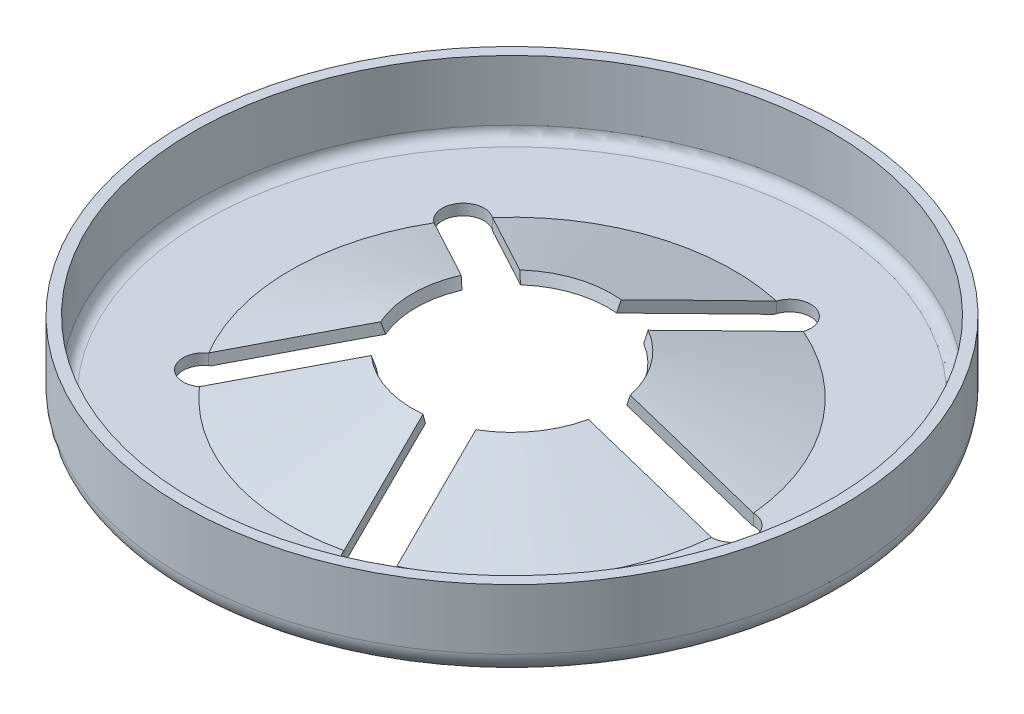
ISO-10303-21;
HEADER;
FILE_DESCRIPTION(('STEP AP214'),'2;1');
FILE_NAME('part.step','',(''),(''),'','','');
FILE_SCHEMA(('AUTOMOTIVE_DESIGN { 1 0 10303 214 1 1 1 1 }'));
ENDSEC;
DATA;
#1=APPLICATION_CONTEXT('core data for automotive mechanical design processes');
#2=APPLICATION_PROTOCOL_DEFINITION('international standard','automotive_design',2000,#1);
#3=PRODUCT_CONTEXT('',#1,'mechanical');
#4=PRODUCT('Part','Part','',(#3));
#5=PRODUCT_RELATED_PRODUCT_CATEGORY('part','',(#4));
#6=PRODUCT_DEFINITION_FORMATION('','',#4);
#7=PRODUCT_DEFINITION_CONTEXT('part definition',#1,'design');
#8=PRODUCT_DEFINITION('design','',#6,#7);
#9=PRODUCT_DEFINITION_SHAPE('','',#8);
#10=(LENGTH_UNIT() NAMED_UNIT(*) SI_UNIT(.MILLI.,.METRE.));
#11=(NAMED_UNIT(*) PLANE_ANGLE_UNIT() SI_UNIT($,.RADIAN.));
#12=(NAMED_UNIT(*) SI_UNIT($,.STERADIAN.) SOLID_ANGLE_UNIT());
#13=UNCERTAINTY_MEASURE_WITH_UNIT(LENGTH_MEASURE(1.E-05),#10,'distance_accuracy_value','');
#14=(GEOMETRIC_REPRESENTATION_CONTEXT(3) GLOBAL_UNCERTAINTY_ASSIGNED_CONTEXT((#13)) GLOBAL_UNIT_ASSIGNED_CONTEXT((#10,
#11,#12)) REPRESENTATION_CONTEXT('',''));
#15=CARTESIAN_POINT('',(0.,0.,0.));
#16=DIRECTION('',(0.,0.,1.));
#17=DIRECTION('',(1.,0.,0.));
#18=AXIS2_PLACEMENT_3D('',#15,#16,#17);
#19=CARTESIAN_POINT('',(0.,0.234866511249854,0.));
#20=DIRECTION('',(0.,-1.,0.));
#21=DIRECTION('',(0.,0.,-1.));
#22=AXIS2_PLACEMENT_3D('',#19,#20,#21);
#23=CONICAL_SURFACE('',#22,4.03245553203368,1.24904577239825);
#24=CARTESIAN_POINT('',(1.60344464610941,0.234666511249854,3.70060835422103));
#25=CARTESIAN_POINT('',(1.603343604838,0.234776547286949,3.70029237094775));
#26=CARTESIAN_POINT('',(1.60324215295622,0.234886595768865,3.69997652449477));
#27=CARTESIAN_POINT('',(1.60303842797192,0.235106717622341,3.69934510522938));
#28=CARTESIAN_POINT('',(1.6029361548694,0.2352167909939,3.69902953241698));
#29=CARTESIAN_POINT('',(1.6028334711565,0.235326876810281,3.69871409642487));
#30=B_SPLINE_CURVE_WITH_KNOTS('',3,(#24,#25,#26,#27,#28,#29),.UNSPECIFIED.,.F.,.F.,(4,2,4),(0.,
0.00104855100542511,0.0020971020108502),.UNSPECIFIED.);
#31=CARTESIAN_POINT('',(1.60326055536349,0.234866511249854,3.70003421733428));
#32=VERTEX_POINT('',#31);
#33=CARTESIAN_POINT('',(1.60289851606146,0.235257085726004,3.69891409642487));
#34=VERTEX_POINT('',#33);
#35=EDGE_CURVE('E242',#32,#34,#30,.T.);
#36=ORIENTED_EDGE('',*,*,#35,.F.);
#37=CARTESIAN_POINT('',(0.,0.234866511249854,0.));
#38=DIRECTION('',(0.,-1.,0.));
#39=DIRECTION('',(0.,0.,-1.));
#40=AXIS2_PLACEMENT_3D('',#37,#38,#39);
#41=CIRCLE('',#40,4.03245553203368);
#42=CARTESIAN_POINT('',(4.01437641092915,0.234866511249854,0.381417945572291));
#43=VERTEX_POINT('',#42);
#44=EDGE_CURVE('E693',#43,#32,#41,.T.);
#45=ORIENTED_EDGE('',*,*,#44,.F.);
#46=CARTESIAN_POINT('',(4.01299923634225,0.235323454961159,0.381419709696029));
#47=CARTESIAN_POINT('',(4.01332924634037,0.235213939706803,0.381419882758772));
#48=CARTESIAN_POINT('',(4.01365925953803,0.23510443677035,0.381419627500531));
#49=CARTESIAN_POINT('',(4.01431929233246,0.234885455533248,0.381418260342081));
#50=CARTESIAN_POINT('',(4.01464931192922,0.234775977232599,0.381417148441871));
#51=CARTESIAN_POINT('',(4.01497933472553,0.234666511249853,0.381415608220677));
#52=B_SPLINE_CURVE_WITH_KNOTS('',3,(#46,#47,#48,#49,#50,#51),.UNSPECIFIED.,.F.,.F.,(4,2,4),(0.,
0.00104311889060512,0.00208623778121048),.UNSPECIFIED.);
#53=CARTESIAN_POINT('',(4.01319923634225,0.235257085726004,0.3814197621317));
#54=VERTEX_POINT('',#53);
#55=EDGE_CURVE('E501',#54,#43,#52,.T.);
#56=ORIENTED_EDGE('',*,*,#55,.F.);
#57=CARTESIAN_POINT('',(-0.0415665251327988,1.45112568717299,0.381419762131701));
#58=CARTESIAN_POINT('',(-0.0248366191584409,1.45173627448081,0.381419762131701));
#59=CARTESIAN_POINT('',(-0.00809478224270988,1.4519736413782,0.381419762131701));
#60=CARTESIAN_POINT('',(0.0253765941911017,1.4517179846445,0.381419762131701));
#61=CARTESIAN_POINT('',(0.042106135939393,1.4512252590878,0.381419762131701));
#62=CARTESIAN_POINT('',(0.0921098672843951,1.44868303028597,0.381419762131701));
#63=CARTESIAN_POINT('',(0.125332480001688,1.44557404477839,0.381419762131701));
#64=CARTESIAN_POINT('',(0.191293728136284,1.43714943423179,0.381419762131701));
#65=CARTESIAN_POINT('',(0.224034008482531,1.4318458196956,0.381419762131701));
#66=CARTESIAN_POINT('',(0.289261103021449,1.41970615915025,0.381419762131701));
#67=CARTESIAN_POINT('',(0.321747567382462,1.41286828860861,0.381419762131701));
#68=CARTESIAN_POINT('',(0.409978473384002,1.39286945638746,0.381419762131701));
#69=CARTESIAN_POINT('',(0.465494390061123,1.37872064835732,0.381419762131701));
#70=CARTESIAN_POINT('',(0.576134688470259,1.34895248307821,0.381419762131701));
#71=CARTESIAN_POINT('',(0.631258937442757,1.33333265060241,0.381419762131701));
#72=CARTESIAN_POINT('',(0.741284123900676,1.3012753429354,0.381419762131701));
#73=CARTESIAN_POINT('',(0.796185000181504,1.28483765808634,0.381419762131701));
#74=CARTESIAN_POINT('',(0.90583074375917,1.25148263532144,0.381419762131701));
#75=CARTESIAN_POINT('',(0.960575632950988,1.23456536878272,0.381419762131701));
#76=CARTESIAN_POINT('',(1.12545730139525,1.18312263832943,0.381419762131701));
#77=CARTESIAN_POINT('',(1.23545209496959,1.14814299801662,0.381419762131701));
#78=CARTESIAN_POINT('',(1.45523399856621,1.07764936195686,0.381419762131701));
#79=CARTESIAN_POINT('',(1.56502115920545,1.04213552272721,0.381419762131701));
#80=CARTESIAN_POINT('',(1.81472792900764,0.960980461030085,0.381419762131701));
#81=CARTESIAN_POINT('',(1.95461675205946,0.915244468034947,0.381419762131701));
#82=CARTESIAN_POINT('',(2.2343232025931,0.823514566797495,0.381419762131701));
#83=CARTESIAN_POINT('',(2.37414082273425,0.777520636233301,0.3814197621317));
#84=CARTESIAN_POINT('',(2.65320046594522,0.685553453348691,0.3814197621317));
#85=CARTESIAN_POINT('',(2.79244267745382,0.639580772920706,0.3814197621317));
#86=CARTESIAN_POINT('',(3.07089109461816,0.547539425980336,0.3814197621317));
#87=CARTESIAN_POINT('',(3.21009730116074,0.501470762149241,0.3814197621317));
#88=CARTESIAN_POINT('',(3.77701996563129,0.313714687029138,0.3814197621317));
#89=CARTESIAN_POINT('',(4.20464999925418,0.171766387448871,0.3814197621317));
#90=CARTESIAN_POINT('',(5.05984428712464,-0.112345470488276,0.3814197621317));
#91=CARTESIAN_POINT('',(5.4874085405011,-0.254509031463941,0.3814197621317));
#92=CARTESIAN_POINT('',(6.3460581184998,-0.540130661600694,0.3814197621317));
#93=CARTESIAN_POINT('',(6.77714313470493,-0.683589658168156,0.3814197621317));
#94=CARTESIAN_POINT('',(7.63928545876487,-0.970572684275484,0.3814197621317));
#95=CARTESIAN_POINT('',(8.07034276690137,-1.11409671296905,0.3814197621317));
#96=CARTESIAN_POINT('',(8.50139658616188,-1.25763117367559,0.3814197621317));
#97=B_SPLINE_CURVE_WITH_KNOTS('',3,(#57,#58,#59,#60,#61,#62,#63,#64,#65,#66,#67,#68,#69,#70,#71,
#72,#73,#74,#75,#76,#77,#78,#79,#80,#81,#82,#83,#84,#85,#86,#87,#88,#89,#90,#91,#92,#93,#94,#95,
#96),.UNSPECIFIED.,.F.,.F.,(4,2,2,2,2,2,2,2,2,2,2,2,2,2,2,2,2,2,2,4),(0.,0.0502160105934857,
0.100411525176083,0.200403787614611,0.299855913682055,0.399426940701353,0.571248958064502,
0.743126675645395,0.915048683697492,1.08694523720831,1.43320940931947,1.77937403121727,
2.22090019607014,2.662465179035,3.10237069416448,3.54226408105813,4.89398529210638,
6.24572308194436,7.60870985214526,8.97167936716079),.UNSPECIFIED.);
#98=CARTESIAN_POINT('',(1.77267549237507,0.974603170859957,0.381419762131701));
#99=VERTEX_POINT('',#98);
#100=EDGE_CURVE('E485',#99,#54,#97,.T.);
#101=ORIENTED_EDGE('',*,*,#100,.F.);
#102=CARTESIAN_POINT('',(0.,0.974603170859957,0.));
#103=DIRECTION('',(0.,-1.,0.));
#104=DIRECTION('',(0.,0.,-1.));
#105=AXIS2_PLACEMENT_3D('',#102,#103,#104);
#106=CIRCLE('',#105,1.81324555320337);
#107=CARTESIAN_POINT('',(0.910538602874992,0.974603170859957,1.56804938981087));
#108=VERTEX_POINT('',#107);
#109=EDGE_CURVE('E480',#99,#108,#106,.T.);
#110=ORIENTED_EDGE('',*,*,#109,.T.);
#111=CARTESIAN_POINT('',(1.60296350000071,0.235187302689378,3.69911409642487));
#112=CARTESIAN_POINT('',(1.54527713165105,0.297130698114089,3.5215737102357));
#113=CARTESIAN_POINT('',(1.48758784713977,0.359045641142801,3.34402434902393));
#114=CARTESIAN_POINT('',(1.37219790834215,0.482763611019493,2.98889063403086));
#115=CARTESIAN_POINT('',(1.31449725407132,0.544566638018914,2.81130628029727));
#116=CARTESIAN_POINT('',(1.19907880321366,0.668006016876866,2.4560848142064));
#117=CARTESIAN_POINT('',(1.14136100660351,0.729642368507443,2.27844770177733));
#118=CARTESIAN_POINT('',(1.02588804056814,0.852548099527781,1.92305845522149));
#119=CARTESIAN_POINT('',(0.968132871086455,0.913817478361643,1.74530632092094));
#120=CARTESIAN_POINT('',(0.910348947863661,0.974803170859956,1.56746569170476));
#121=B_SPLINE_CURVE_WITH_KNOTS('',3,(#111,#112,#113,#114,#115,#116,#117,#118,#119,#120),
.UNSPECIFIED.,.F.,.F.,(4,2,2,2,4),(0.,0.590057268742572,1.18011373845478,1.77017101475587,
2.36022918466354),.UNSPECIFIED.);
#122=EDGE_CURVE('E312',#34,#108,#121,.T.);
#123=ORIENTED_EDGE('',*,*,#122,.F.);
#124=EDGE_LOOP('',(#36,#45,#56,#101,#110,#123));
#125=FACE_BOUND('',#124,.T.);
#126=ADVANCED_FACE('F34',(#125),#23,.T.);
#127=CARTESIAN_POINT('',(0.,0.0348665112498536,0.));
#128=DIRECTION('',(0.,-1.,0.));
#129=DIRECTION('',(0.,0.,-1.));
#130=AXIS2_PLACEMENT_3D('',#127,#128,#129);
#131=CONICAL_SURFACE('',#130,4.,1.24904577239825);
#132=CARTESIAN_POINT('',(0.,0.0348665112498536,0.));
#133=DIRECTION('',(0.,-1.,0.));
#134=DIRECTION('',(0.,0.,-1.));
#135=AXIS2_PLACEMENT_3D('',#132,#133,#134);
#136=CIRCLE('',#135,4.);
#137=CARTESIAN_POINT('',(3.98177334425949,0.0348665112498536,0.3814197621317));
#138=VERTEX_POINT('',#137);
#139=CARTESIAN_POINT('',(1.59318738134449,0.0348665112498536,3.66902629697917));
#140=VERTEX_POINT('',#139);
#141=EDGE_CURVE('E713',#138,#140,#136,.T.);
#142=ORIENTED_EDGE('',*,*,#141,.T.);
#143=CARTESIAN_POINT('',(1.59337364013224,0.0346665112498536,3.66959954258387));
#144=CARTESIAN_POINT('',(1.53482139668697,0.0975314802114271,3.48939426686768));
#145=CARTESIAN_POINT('',(1.47626659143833,0.160371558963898,3.30918110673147));
#146=CARTESIAN_POINT('',(1.35914485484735,0.285932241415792,2.94871746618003));
#147=CARTESIAN_POINT('',(1.30057792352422,0.348652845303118,2.76846698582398));
#148=CARTESIAN_POINT('',(1.18342465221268,0.473905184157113,2.40790629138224));
#149=CARTESIAN_POINT('',(1.12483831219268,0.536436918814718,2.22759607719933));
#150=CARTESIAN_POINT('',(1.03693070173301,0.629958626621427,1.95704427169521));
#151=CARTESIAN_POINT('',(1.00762345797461,0.661086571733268,1.86684585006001));
#152=CARTESIAN_POINT('',(0.948994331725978,0.723198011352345,1.68640395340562));
#153=CARTESIAN_POINT('',(0.919672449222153,0.75418150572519,1.59616047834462));
#154=CARTESIAN_POINT('',(0.890340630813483,0.785066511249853,1.50588642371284));
#155=B_SPLINE_CURVE_WITH_KNOTS('',3,(#143,#144,#145,#146,#147,#148,#149,#150,#151,#152,#153,
#154),.UNSPECIFIED.,.F.,.F.,(4,2,2,2,2,4),(0.,0.598906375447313,1.19781180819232,
1.7967182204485,2.09617190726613,2.39562587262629),.UNSPECIFIED.);
#156=CARTESIAN_POINT('',(0.890530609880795,0.784866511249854,1.50647111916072));
#157=VERTEX_POINT('',#156);
#158=EDGE_CURVE('E252',#140,#157,#155,.T.);
#159=ORIENTED_EDGE('',*,*,#158,.T.);
#160=CARTESIAN_POINT('',(0.,0.784866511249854,0.));
#161=DIRECTION('',(0.,-1.,0.));
#162=DIRECTION('',(0.,0.,-1.));
#163=AXIS2_PLACEMENT_3D('',#160,#161,#162);
#164=CIRCLE('',#163,1.75);
#165=CARTESIAN_POINT('',(1.70792826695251,0.784866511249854,0.381419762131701));
#166=VERTEX_POINT('',#165);
#167=EDGE_CURVE('E482',#166,#157,#164,.T.);
#168=ORIENTED_EDGE('',*,*,#167,.F.);
#169=CARTESIAN_POINT('',(-0.0415578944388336,1.24030748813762,0.381419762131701));
#170=CARTESIAN_POINT('',(-0.0248279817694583,1.24091795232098,0.381419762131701));
#171=CARTESIAN_POINT('',(-0.00808614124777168,1.24115519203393,0.381419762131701));
#172=CARTESIAN_POINT('',(0.0253852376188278,1.24089928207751,0.381419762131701));
#173=CARTESIAN_POINT('',(0.0421147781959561,1.24040643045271,0.381419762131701));
#174=CARTESIAN_POINT('',(0.0921186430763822,1.23786383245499,0.381419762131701));
#175=CARTESIAN_POINT('',(0.125341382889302,1.23475460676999,0.381419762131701));
#176=CARTESIAN_POINT('',(0.191302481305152,1.22632959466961,0.381419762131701));
#177=CARTESIAN_POINT('',(0.224042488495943,1.22102584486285,0.381419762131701));
#178=CARTESIAN_POINT('',(0.289269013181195,1.20888606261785,0.381419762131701));
#179=CARTESIAN_POINT('',(0.321755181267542,1.2020482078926,0.381419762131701));
#180=CARTESIAN_POINT('',(0.409691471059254,1.18211572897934,0.381419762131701));
#181=CARTESIAN_POINT('',(0.464916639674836,1.16804866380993,0.381419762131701));
#182=CARTESIAN_POINT('',(0.574978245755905,1.13845368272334,0.381419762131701));
#183=CARTESIAN_POINT('',(0.629814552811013,1.12292529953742,0.381419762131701));
#184=CARTESIAN_POINT('',(0.739264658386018,1.09105458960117,0.381419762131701));
#185=CARTESIAN_POINT('',(0.793878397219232,1.07471205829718,0.381419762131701));
#186=CARTESIAN_POINT('',(0.902950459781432,1.04154855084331,0.381419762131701));
#187=CARTESIAN_POINT('',(0.957408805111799,1.0247276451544,0.381419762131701));
#188=CARTESIAN_POINT('',(1.12142440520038,0.973576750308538,0.381419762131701));
#189=CARTESIAN_POINT('',(1.23083992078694,0.938793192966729,0.381419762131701));
#190=CARTESIAN_POINT('',(1.44946365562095,0.868691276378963,0.381419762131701));
#191=CARTESIAN_POINT('',(1.55867192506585,0.833373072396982,0.381419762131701));
#192=CARTESIAN_POINT('',(1.80725160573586,0.752600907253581,0.381419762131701));
#193=CARTESIAN_POINT('',(1.94659197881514,0.707051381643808,0.381419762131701));
#194=CARTESIAN_POINT('',(2.22520105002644,0.61569342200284,0.381419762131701));
#195=CARTESIAN_POINT('',(2.36446974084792,0.569884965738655,0.3814197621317));
#196=CARTESIAN_POINT('',(2.64243447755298,0.47828705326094,0.3814197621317));
#197=CARTESIAN_POINT('',(2.78113071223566,0.432498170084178,0.3814197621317));
#198=CARTESIAN_POINT('',(3.05848708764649,0.340823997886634,0.3814197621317));
#199=CARTESIAN_POINT('',(3.19714722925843,0.294938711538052,0.3814197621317));
#200=CARTESIAN_POINT('',(3.76282010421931,0.107606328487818,0.3814197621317));
#201=CARTESIAN_POINT('',(4.18974564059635,-0.0341040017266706,0.3814197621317));
#202=CARTESIAN_POINT('',(5.04353044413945,-0.317741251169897,0.3814197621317));
#203=CARTESIAN_POINT('',(5.47038971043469,-0.459668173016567,0.3814197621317));
#204=CARTESIAN_POINT('',(6.32762232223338,-0.744814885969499,0.3814197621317));
#205=CARTESIAN_POINT('',(6.75799535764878,-0.888035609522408,0.3814197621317));
#206=CARTESIAN_POINT('',(7.61871365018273,-1.17454244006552,0.3814197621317));
#207=CARTESIAN_POINT('',(8.04905890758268,-1.3178285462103,0.3814197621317));
#208=CARTESIAN_POINT('',(8.47940067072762,-1.46112509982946,0.3814197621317));
#209=B_SPLINE_CURVE_WITH_KNOTS('',3,(#169,#170,#171,#172,#173,#174,#175,#176,#177,#178,#179,
#180,#181,#182,#183,#184,#185,#186,#187,#188,#189,#190,#191,#192,#193,#194,#195,#196,#197,#198,
#199,#200,#201,#202,#203,#204,#205,#206,#207,#208),.UNSPECIFIED.,.F.,.F.,(4,2,2,2,2,2,2,2,2,2,2,
2,2,2,2,2,2,2,2,4),(0.,0.0502160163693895,0.100411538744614,0.200404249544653,0.299855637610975,
0.399425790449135,0.570342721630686,0.741314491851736,0.912329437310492,1.08331932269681,
1.42774910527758,1.7720807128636,2.21186914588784,2.65169593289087,3.08987322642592,
3.52803853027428,4.87752895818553,6.2270358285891,7.58777022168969,8.94848749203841),.UNSPECIFIED.);
#210=EDGE_CURVE('E329',#166,#138,#209,.T.);
#211=ORIENTED_EDGE('',*,*,#210,.T.);
#212=EDGE_LOOP('',(#142,#159,#168,#211));
#213=FACE_BOUND('',#212,.T.);
#214=ADVANCED_FACE('F323',(#213),#131,.F.);
#215=CARTESIAN_POINT('',(0.,0.784866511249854,0.));
#216=DIRECTION('',(0.,1.,0.));
#217=DIRECTION('',(0.,0.,1.));
#218=AXIS2_PLACEMENT_3D('',#215,#216,#217);
#219=CONICAL_SURFACE('',#218,1.75,0.321750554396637);
#220=ORIENTED_EDGE('',*,*,#167,.T.);
#221=CARTESIAN_POINT('',(0.890509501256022,0.784666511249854,1.50640615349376));
#222=CARTESIAN_POINT('',(0.89385375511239,0.816353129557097,1.51669870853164));
#223=CARTESIAN_POINT('',(0.897196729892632,0.848041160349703,1.52698732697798));
#224=CARTESIAN_POINT('',(0.903880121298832,0.911420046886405,1.54755669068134));
#225=CARTESIAN_POINT('',(0.907220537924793,0.943110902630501,1.55783743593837));
#226=CARTESIAN_POINT('',(0.910559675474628,0.974803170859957,1.56811424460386));
#227=B_SPLINE_CURVE_WITH_KNOTS('',3,(#221,#222,#223,#224,#225,#226),.UNSPECIFIED.,.F.,.F.,(4,2,
4),(0.,0.1004512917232,0.200902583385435),.UNSPECIFIED.);
#228=EDGE_CURVE('E300',#157,#108,#227,.T.);
#229=ORIENTED_EDGE('',*,*,#228,.T.);
#230=ORIENTED_EDGE('',*,*,#109,.F.);
#231=CARTESIAN_POINT('',(2.10965527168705,1.96644000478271,0.381419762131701));
#232=CARTESIAN_POINT('',(2.04834561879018,1.78545537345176,0.3814197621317));
#233=CARTESIAN_POINT('',(1.986966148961,1.60449433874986,0.381419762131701));
#234=CARTESIAN_POINT('',(1.86400617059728,1.24264109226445,0.381419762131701));
#235=CARTESIAN_POINT('',(1.80242566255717,1.0617488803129,0.381419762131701));
#236=CARTESIAN_POINT('',(1.67900181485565,0.700053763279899,0.381419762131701));
#237=CARTESIAN_POINT('',(1.61715847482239,0.519250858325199,0.381419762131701));
#238=CARTESIAN_POINT('',(1.49308936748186,0.157775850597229,0.381419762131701));
#239=CARTESIAN_POINT('',(1.43086359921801,-0.0228962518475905,0.381419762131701));
#240=CARTESIAN_POINT('',(1.3683869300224,-0.203481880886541,0.381419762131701));
#241=B_SPLINE_CURVE_WITH_KNOTS('',3,(#231,#232,#233,#234,#235,#236,#237,#238,#239,#240),
.UNSPECIFIED.,.F.,.F.,(4,2,2,2,4),(0.,0.573261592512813,1.14652177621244,1.71978277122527,
2.29304520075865),.UNSPECIFIED.);
#242=EDGE_CURVE('E532',#99,#166,#241,.T.);
#243=ORIENTED_EDGE('',*,*,#242,.T.);
#244=EDGE_LOOP('',(#220,#229,#230,#243));
#245=FACE_BOUND('',#244,.T.);
#246=ADVANCED_FACE('F478',(#245),#219,.F.);
#247=CARTESIAN_POINT('',(0.877195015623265,0.235472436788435,3.934027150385));
#248=CARTESIAN_POINT('',(0.877319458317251,0.235338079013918,3.93441237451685));
#249=CARTESIAN_POINT('',(0.877444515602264,0.235203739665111,3.93479740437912));
#250=CARTESIAN_POINT('',(0.877695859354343,0.234935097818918,3.9355670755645));
#251=CARTESIAN_POINT('',(0.877822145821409,0.234800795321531,3.93595171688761));
#252=CARTESIAN_POINT('',(0.877949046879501,0.234666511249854,3.93633616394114));
#253=B_SPLINE_CURVE_WITH_KNOTS('',3,(#247,#248,#249,#250,#251,#252),.UNSPECIFIED.,.F.,.F.,(4,2,
4),(0.,0.00127961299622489,0.00255922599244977),.UNSPECIFIED.);
#254=CARTESIAN_POINT('',(0.87739501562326,0.235257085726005,3.93464447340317));
#255=VERTEX_POINT('',#254);
#256=CARTESIAN_POINT('',(0.877760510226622,0.234866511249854,3.93576347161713));
#257=VERTEX_POINT('',#256);
#258=EDGE_CURVE('E466',#255,#257,#253,.T.);
#259=ORIENTED_EDGE('',*,*,#258,.F.);
#260=CARTESIAN_POINT('',(0.184845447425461,0.974803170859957,1.80319606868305));
#261=CARTESIAN_POINT('',(0.230393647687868,0.926747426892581,1.94337901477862));
#262=CARTESIAN_POINT('',(0.275922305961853,0.878498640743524,2.08350181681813));
#263=CARTESIAN_POINT('',(0.36695308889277,0.781740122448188,2.36366575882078));
#264=CARTESIAN_POINT('',(0.412455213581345,0.73323039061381,2.5037068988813));
#265=CARTESIAN_POINT('',(0.54894064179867,0.587497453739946,2.92376585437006));
#266=CARTESIAN_POINT('',(0.639903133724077,0.49007036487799,3.20371961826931));
#267=CARTESIAN_POINT('',(0.755289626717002,0.366318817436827,3.55884272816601));
#268=CARTESIAN_POINT('',(0.779724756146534,0.340102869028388,3.63404632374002));
#269=CARTESIAN_POINT('',(0.828593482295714,0.287655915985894,3.78444879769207));
#270=CARTESIAN_POINT('',(0.853027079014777,0.261424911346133,3.85964767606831));
#271=CARTESIAN_POINT('',(0.877459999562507,0.235187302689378,3.93484447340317));
#272=B_SPLINE_CURVE_WITH_KNOTS('',3,(#260,#261,#262,#263,#264,#265,#266,#267,#268,#269,#270,
#271),.UNSPECIFIED.,.F.,.F.,(4,2,2,2,2,4),(0.,0.465098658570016,0.930196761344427,
1.86039159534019,2.11031036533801,2.36022923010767),.UNSPECIFIED.);
#273=CARTESIAN_POINT('',(0.185035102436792,0.974603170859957,1.80377976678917));
#274=VERTEX_POINT('',#273);
#275=EDGE_CURVE('E294',#274,#255,#272,.T.);
#276=ORIENTED_EDGE('',*,*,#275,.F.);
#277=CARTESIAN_POINT('',(-1.20993168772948,0.974603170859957,1.35052758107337));
#278=VERTEX_POINT('',#277);
#279=EDGE_CURVE('E487',#274,#278,#106,.T.);
#280=ORIENTED_EDGE('',*,*,#279,.T.);
#281=CARTESIAN_POINT('',(-3.0227534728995,0.235175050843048,2.66761970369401));
#282=CARTESIAN_POINT('',(-2.87172611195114,0.29711947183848,2.55789190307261));
#283=CARTESIAN_POINT('',(-2.7206911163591,0.359035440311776,2.44815855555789));
#284=CARTESIAN_POINT('',(-2.41859135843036,0.482755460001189,2.22867023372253));
#285=CARTESIAN_POINT('',(-2.26752659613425,0.544559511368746,2.11891525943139));
#286=CARTESIAN_POINT('',(-1.96535219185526,0.668000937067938,1.89937270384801));
#287=CARTESIAN_POINT('',(-1.81424254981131,0.729638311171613,1.78958512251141));
#288=CARTESIAN_POINT('',(-1.51192542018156,0.852546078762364,1.56993887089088));
#289=CARTESIAN_POINT('',(-1.36071793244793,0.913816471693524,1.46008020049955));
#290=CARTESIAN_POINT('',(-1.2094351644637,0.974803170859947,1.35016683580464));
#291=B_SPLINE_CURVE_WITH_KNOTS('',3,(#281,#282,#283,#284,#285,#286,#287,#288,#289,#290),
.UNSPECIFIED.,.F.,.F.,(4,2,2,2,4),(0.,0.590066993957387,1.18013318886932,1.77020019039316,
2.36026808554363),.UNSPECIFIED.);
#292=CARTESIAN_POINT('',(-3.0225534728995,0.235257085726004,2.66747439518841));
#293=VERTEX_POINT('',#292);
#294=EDGE_CURVE('E404',#293,#278,#291,.T.);
#295=ORIENTED_EDGE('',*,*,#294,.F.);
#296=CARTESIAN_POINT('',(-3.02399604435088,0.234666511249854,2.66851735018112));
#297=CARTESIAN_POINT('',(-3.02372174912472,0.234778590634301,2.66832001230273));
#298=CARTESIAN_POINT('',(-3.02344772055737,0.234890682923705,2.66812231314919));
#299=CARTESIAN_POINT('',(-3.02290019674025,0.235114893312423,2.66772619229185));
#300=CARTESIAN_POINT('',(-3.02262670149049,0.235227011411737,2.66752777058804));
#301=CARTESIAN_POINT('',(-3.02235347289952,0.235339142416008,2.6673289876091));
#302=B_SPLINE_CURVE_WITH_KNOTS('',3,(#296,#297,#298,#299,#300,#301),.UNSPECIFIED.,.F.,.F.,(4,2,
4),(0.,0.00106802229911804,0.00213604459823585),.UNSPECIFIED.);
#303=CARTESIAN_POINT('',(-3.02350689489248,0.234866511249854,2.66816485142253));
#304=VERTEX_POINT('',#303);
#305=EDGE_CURVE('E751',#304,#293,#302,.T.);
#306=ORIENTED_EDGE('',*,*,#305,.F.);
#307=EDGE_CURVE('E691',#257,#304,#41,.T.);
#308=ORIENTED_EDGE('',*,*,#307,.F.);
#309=EDGE_LOOP('',(#259,#276,#280,#295,#306,#308));
#310=FACE_BOUND('',#309,.T.);
#311=ADVANCED_FACE('F776',(#310),#23,.T.);
#312=CARTESIAN_POINT('',(0.165027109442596,0.784866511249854,1.74220149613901));
#313=VERTEX_POINT('',#312);
#314=CARTESIAN_POINT('',(-1.157550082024,0.784866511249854,1.31247011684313));
#315=VERTEX_POINT('',#314);
#316=EDGE_CURVE('E716',#313,#315,#164,.T.);
#317=ORIENTED_EDGE('',*,*,#316,.F.);
#318=CARTESIAN_POINT('',(0.164837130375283,0.785066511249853,1.74161680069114));
#319=CARTESIAN_POINT('',(0.208803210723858,0.738757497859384,1.87693048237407));
#320=CARTESIAN_POINT('',(0.252749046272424,0.692248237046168,2.0121818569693));
#321=CARTESIAN_POINT('',(0.340613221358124,0.598959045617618,2.28259998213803));
#322=CARTESIAN_POINT('',(0.384531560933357,0.552179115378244,2.41776673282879));
#323=CARTESIAN_POINT('',(0.516264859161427,0.411628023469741,2.8232001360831));
#324=CARTESIAN_POINT('',(0.60405824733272,0.317645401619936,3.09340040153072));
#325=CARTESIAN_POINT('',(0.721180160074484,0.192086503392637,3.45386458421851));
#326=CARTESIAN_POINT('',(0.750519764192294,0.160618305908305,3.54416260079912));
#327=CARTESIAN_POINT('',(0.809196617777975,0.0976587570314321,3.72475138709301));
#328=CARTESIAN_POINT('',(0.838533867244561,0.0661674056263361,3.81504215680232));
#329=CARTESIAN_POINT('',(0.867870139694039,0.0346665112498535,3.90532991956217));
#330=B_SPLINE_CURVE_WITH_KNOTS('',3,(#318,#319,#320,#321,#322,#323,#324,#325,#326,#327,#328,
#329),.UNSPECIFIED.,.F.,.F.,(4,2,2,2,2,4),(0.,0.448871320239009,0.897742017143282,
1.79548187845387,2.09555374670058,2.39562577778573),.UNSPECIFIED.);
#331=CARTESIAN_POINT('',(0.867683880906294,0.0348665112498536,3.90475667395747));
#332=VERTEX_POINT('',#331);
#333=EDGE_CURVE('E273',#313,#332,#330,.T.);
#334=ORIENTED_EDGE('',*,*,#333,.T.);
#335=CARTESIAN_POINT('',(-2.99712939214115,0.0348665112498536,2.64900271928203));
#336=VERTEX_POINT('',#335);
#337=EDGE_CURVE('E714',#332,#336,#136,.T.);
#338=ORIENTED_EDGE('',*,*,#337,.T.);
#339=CARTESIAN_POINT('',(-2.99761702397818,0.0346665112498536,2.64935700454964));
#340=CARTESIAN_POINT('',(-2.84432526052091,0.0975314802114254,2.53798401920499));
#341=CARTESIAN_POINT('',(-2.69102679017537,0.160371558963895,2.42660616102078));
#342=CARTESIAN_POINT('',(-2.38439810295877,0.285932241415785,2.20382737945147));
#343=CARTESIAN_POINT('',(-2.23106788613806,0.34865284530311,2.09242645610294));
#344=CARTESIAN_POINT('',(-1.92435663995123,0.473905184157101,1.86958769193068));
#345=CARTESIAN_POINT('',(-1.77097561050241,0.536436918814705,1.75814985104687));
#346=CARTESIAN_POINT('',(-1.54083049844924,0.629958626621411,1.59093963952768));
#347=CARTESIAN_POINT('',(-1.46410313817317,0.661086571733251,1.53519394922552));
#348=CARTESIAN_POINT('',(-1.31061009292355,0.723198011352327,1.42367472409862));
#349=CARTESIAN_POINT('',(-1.23384440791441,0.754181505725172,1.36790118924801));
#350=CARTESIAN_POINT('',(-1.15705271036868,0.785066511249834,1.31210875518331));
#351=B_SPLINE_CURVE_WITH_KNOTS('',3,(#339,#340,#341,#342,#343,#344,#345,#346,#347,#348,#349,
#350),.UNSPECIFIED.,.F.,.F.,(4,2,2,2,2,4),(0.,0.598906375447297,1.19781180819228,
1.79671822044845,2.09617190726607,2.39562587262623),.UNSPECIFIED.);
#352=EDGE_CURVE('E396',#336,#315,#351,.T.);
#353=ORIENTED_EDGE('',*,*,#352,.T.);
#354=EDGE_LOOP('',(#317,#334,#338,#353));
#355=FACE_BOUND('',#354,.T.);
#356=ADVANCED_FACE('F740',(#355),#131,.F.);
#357=ORIENTED_EDGE('',*,*,#279,.F.);
#358=CARTESIAN_POINT('',(0.185056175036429,0.974803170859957,1.80384462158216));
#359=CARTESIAN_POINT('',(0.181717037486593,0.943110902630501,1.79356781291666));
#360=CARTESIAN_POINT('',(0.178376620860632,0.911420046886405,1.78328706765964));
#361=CARTESIAN_POINT('',(0.171693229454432,0.848041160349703,1.76271770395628));
#362=CARTESIAN_POINT('',(0.16835025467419,0.816353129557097,1.75242908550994));
#363=CARTESIAN_POINT('',(0.165006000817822,0.784666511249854,1.74213653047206));
#364=B_SPLINE_CURVE_WITH_KNOTS('',3,(#358,#359,#360,#361,#362,#363),.UNSPECIFIED.,.F.,.F.,(4,2,
4),(0.,0.100451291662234,0.200902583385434),.UNSPECIFIED.);
#365=EDGE_CURVE('E245',#274,#313,#364,.T.);
#366=ORIENTED_EDGE('',*,*,#365,.T.);
#367=ORIENTED_EDGE('',*,*,#316,.T.);
#368=CARTESIAN_POINT('',(-1.1574948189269,0.784666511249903,1.31242996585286));
#369=CARTESIAN_POINT('',(-1.16625018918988,0.816353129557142,1.31879111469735));
#370=CARTESIAN_POINT('',(-1.17500221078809,0.848041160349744,1.32514983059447));
#371=CARTESIAN_POINT('',(-1.19249955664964,0.911420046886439,1.3378623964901));
#372=CARTESIAN_POINT('',(-1.20124488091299,0.94311090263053,1.34421624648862));
#373=CARTESIAN_POINT('',(-1.20998685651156,0.974803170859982,1.35056766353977));
#374=B_SPLINE_CURVE_WITH_KNOTS('',3,(#368,#369,#370,#371,#372,#373),.UNSPECIFIED.,.F.,.F.,(4,2,
4),(0.,0.100451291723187,0.200902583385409),.UNSPECIFIED.);
#375=EDGE_CURVE('E405',#315,#278,#374,.T.);
#376=ORIENTED_EDGE('',*,*,#375,.T.);
#377=EDGE_LOOP('',(#357,#366,#367,#376));
#378=FACE_BOUND('',#377,.T.);
#379=ADVANCED_FACE('F796',(#378),#219,.F.);
#380=CARTESIAN_POINT('',(-3.47066376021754,0.235370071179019,2.05012425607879));
#381=CARTESIAN_POINT('',(-3.47094986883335,0.235252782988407,2.05033173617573));
#382=CARTESIAN_POINT('',(-3.47123569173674,0.235135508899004,2.05053961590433));
#383=CARTESIAN_POINT('',(-3.4718067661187,0.234900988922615,2.05095617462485));
#384=CARTESIAN_POINT('',(-3.47209201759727,0.23478374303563,2.05116485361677));
#385=CARTESIAN_POINT('',(-3.47237698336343,0.234666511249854,2.05137393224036));
#386=B_SPLINE_CURVE_WITH_KNOTS('',3,(#380,#381,#382,#383,#384,#385),.UNSPECIFIED.,.F.,.F.,(4,2,
4),(0.,0.00111712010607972,0.00223424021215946),.UNSPECIFIED.);
#387=CARTESIAN_POINT('',(-3.47093929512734,0.235257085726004,2.05032425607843));
#388=VERTEX_POINT('',#387);
#389=CARTESIAN_POINT('',(-3.47189058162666,0.234866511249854,2.05101765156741));
#390=VERTEX_POINT('',#389);
#391=EDGE_CURVE('E747',#388,#390,#386,.T.);
#392=ORIENTED_EDGE('',*,*,#391,.F.);
#393=CARTESIAN_POINT('',(-1.65782098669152,0.974803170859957,0.733016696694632));
#394=CARTESIAN_POINT('',(-1.77706772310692,0.926747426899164,0.819654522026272));
#395=CARTESIAN_POINT('',(-1.89626329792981,0.878498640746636,0.906255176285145));
#396=CARTESIAN_POINT('',(-2.134584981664,0.781740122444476,1.07940601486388));
#397=CARTESIAN_POINT('',(-2.25371109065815,0.733230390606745,1.16595619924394));
#398=CARTESIAN_POINT('',(-2.61103458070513,0.587497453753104,1.42556691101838));
#399=CARTESIAN_POINT('',(-2.84917747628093,0.490070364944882,1.59858785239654));
#400=CARTESIAN_POINT('',(-3.15126821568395,0.366316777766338,1.81806962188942));
#401=CARTESIAN_POINT('',(-3.21524519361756,0.340098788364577,1.86455161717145));
#402=CARTESIAN_POINT('',(-3.34319513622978,0.287647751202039,1.95751269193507));
#403=CARTESIAN_POINT('',(-3.40716810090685,0.261414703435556,2.00399177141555));
#404=CARTESIAN_POINT('',(-3.47113929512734,0.235175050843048,2.05046956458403));
#405=B_SPLINE_CURVE_WITH_KNOTS('',3,(#393,#394,#395,#396,#397,#398,#399,#400,#401,#402,#403,
#404),.UNSPECIFIED.,.F.,.F.,(4,2,2,2,2,4),(0.,0.465098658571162,0.930196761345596,
1.86039159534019,2.11032981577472,2.36026813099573),.UNSPECIFIED.);
#406=CARTESIAN_POINT('',(-1.65831750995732,0.974603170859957,0.733377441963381));
#407=VERTEX_POINT('',#406);
#408=EDGE_CURVE('E436',#407,#388,#405,.T.);
#409=ORIENTED_EDGE('',*,*,#408,.F.);
#410=CARTESIAN_POINT('',(-1.65831750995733,0.974603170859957,-0.733377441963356));
#411=VERTEX_POINT('',#410);
#412=EDGE_CURVE('E492',#407,#411,#106,.T.);
#413=ORIENTED_EDGE('',*,*,#412,.T.);
#414=CARTESIAN_POINT('',(-3.47113929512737,0.235175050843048,-2.05046956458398));
#415=CARTESIAN_POINT('',(-3.320111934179,0.297119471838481,-1.94074176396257));
#416=CARTESIAN_POINT('',(-3.16907693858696,0.359035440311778,-1.83100841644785));
#417=CARTESIAN_POINT('',(-2.86697718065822,0.482755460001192,-1.6115200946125));
#418=CARTESIAN_POINT('',(-2.7159124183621,0.54455951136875,-1.50176512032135));
#419=CARTESIAN_POINT('',(-2.4137380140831,0.668000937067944,-1.28222256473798));
#420=CARTESIAN_POINT('',(-2.26262837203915,0.72963831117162,-1.17243498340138));
#421=CARTESIAN_POINT('',(-1.96031124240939,0.852546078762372,-0.952788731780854));
#422=CARTESIAN_POINT('',(-1.80910375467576,0.913816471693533,-0.84293006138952));
#423=CARTESIAN_POINT('',(-1.65782098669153,0.974803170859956,-0.733016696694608));
#424=B_SPLINE_CURVE_WITH_KNOTS('',3,(#414,#415,#416,#417,#418,#419,#420,#421,#422,#423),
.UNSPECIFIED.,.F.,.F.,(4,2,2,2,4),(0.,0.590066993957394,1.18013318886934,1.77020019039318,
2.36026808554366),.UNSPECIFIED.);
#425=CARTESIAN_POINT('',(-3.47093929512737,0.235257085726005,-2.05032425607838));
#426=VERTEX_POINT('',#425);
#427=EDGE_CURVE('E657',#426,#411,#424,.T.);
#428=ORIENTED_EDGE('',*,*,#427,.F.);
#429=CARTESIAN_POINT('',(-3.47237698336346,0.234666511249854,-2.05137393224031));
#430=CARTESIAN_POINT('',(-3.4720920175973,0.23478374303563,-2.05116485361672));
#431=CARTESIAN_POINT('',(-3.47180676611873,0.234900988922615,-2.0509561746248));
#432=CARTESIAN_POINT('',(-3.47123569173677,0.235135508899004,-2.05053961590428));
#433=CARTESIAN_POINT('',(-3.47094986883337,0.235252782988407,-2.05033173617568));
#434=CARTESIAN_POINT('',(-3.47066376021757,0.235370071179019,-2.05012425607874));
#435=B_SPLINE_CURVE_WITH_KNOTS('',3,(#429,#430,#431,#432,#433,#434),.UNSPECIFIED.,.F.,.F.,(4,2,
4),(0.,0.00111712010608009,0.00223424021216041),.UNSPECIFIED.);
#436=CARTESIAN_POINT('',(-3.47189058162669,0.234866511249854,-2.05101765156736));
#437=VERTEX_POINT('',#436);
#438=EDGE_CURVE('E614',#437,#426,#435,.T.);
#439=ORIENTED_EDGE('',*,*,#438,.F.);
#440=EDGE_CURVE('E686',#390,#437,#41,.T.);
#441=ORIENTED_EDGE('',*,*,#440,.F.);
#442=EDGE_LOOP('',(#392,#409,#413,#428,#439,#441));
#443=FACE_BOUND('',#442,.T.);
#444=ADVANCED_FACE('F749',(#443),#23,.T.);
#445=CARTESIAN_POINT('',(-1.60593590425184,0.784866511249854,0.695319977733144));
#446=VERTEX_POINT('',#445);
#447=CARTESIAN_POINT('',(-1.60593590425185,0.784866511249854,-0.695319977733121));
#448=VERTEX_POINT('',#447);
#449=EDGE_CURVE('E718',#446,#448,#164,.T.);
#450=ORIENTED_EDGE('',*,*,#449,.F.);
#451=CARTESIAN_POINT('',(-1.60543853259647,0.785066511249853,0.694958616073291));
#452=CARTESIAN_POINT('',(-1.72054322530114,0.738757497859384,0.778587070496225));
#453=CARTESIAN_POINT('',(-1.83559491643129,0.692248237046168,0.862177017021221));
#454=CARTESIAN_POINT('',(-2.06562631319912,0.598959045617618,1.02930460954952));
#455=CARTESIAN_POINT('',(-2.18060601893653,0.552179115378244,1.1128422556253));
#456=CARTESIAN_POINT('',(-2.52548827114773,0.411628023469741,1.36341387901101));
#457=CARTESIAN_POINT('',(-2.75533434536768,0.317645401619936,1.53040682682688));
#458=CARTESIAN_POINT('',(-3.06196349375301,0.192086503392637,1.75318594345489));
#459=CARTESIAN_POINT('',(-3.13877557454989,0.160618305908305,1.80899318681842));
#460=CARTESIAN_POINT('',(-3.2923935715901,0.097658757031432,1.92060319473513));
#461=CARTESIAN_POINT('',(-3.36919948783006,0.0661674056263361,1.97640595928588));
#462=CARTESIAN_POINT('',(-3.44600284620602,0.0346665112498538,2.03220686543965));
#463=B_SPLINE_CURVE_WITH_KNOTS('',3,(#451,#452,#453,#454,#455,#456,#457,#458,#459,#460,#461,
#462),.UNSPECIFIED.,.F.,.F.,(4,2,2,2,2,4),(0.,0.448871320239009,0.897742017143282,
1.79548187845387,2.09555374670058,2.39562577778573),.UNSPECIFIED.);
#464=CARTESIAN_POINT('',(-3.44551521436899,0.0348665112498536,2.03185258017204));
#465=VERTEX_POINT('',#464);
#466=EDGE_CURVE('E387',#446,#465,#463,.T.);
#467=ORIENTED_EDGE('',*,*,#466,.T.);
#468=CARTESIAN_POINT('',(-3.44551521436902,0.0348665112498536,-2.03185258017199));
#469=VERTEX_POINT('',#468);
#470=EDGE_CURVE('E736',#465,#469,#136,.T.);
#471=ORIENTED_EDGE('',*,*,#470,.T.);
#472=CARTESIAN_POINT('',(-3.44600284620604,0.0346665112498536,-2.0322068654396));
#473=CARTESIAN_POINT('',(-3.29271108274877,0.0975314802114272,-1.92083388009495));
#474=CARTESIAN_POINT('',(-3.13941261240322,0.160371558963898,-1.80945602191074));
#475=CARTESIAN_POINT('',(-2.83278392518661,0.285932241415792,-1.58667724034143));
#476=CARTESIAN_POINT('',(-2.6794537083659,0.348652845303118,-1.4752763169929));
#477=CARTESIAN_POINT('',(-2.37274246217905,0.473905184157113,-1.25243755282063));
#478=CARTESIAN_POINT('',(-2.21936143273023,0.536436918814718,-1.14099971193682));
#479=CARTESIAN_POINT('',(-1.98921632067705,0.629958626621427,-0.973789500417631));
#480=CARTESIAN_POINT('',(-1.91248896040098,0.661086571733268,-0.918043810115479));
#481=CARTESIAN_POINT('',(-1.75899591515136,0.723198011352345,-0.806524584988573));
#482=CARTESIAN_POINT('',(-1.68223023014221,0.754181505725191,-0.750751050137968));
#483=CARTESIAN_POINT('',(-1.60543853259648,0.785066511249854,-0.694958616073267));
#484=B_SPLINE_CURVE_WITH_KNOTS('',3,(#472,#473,#474,#475,#476,#477,#478,#479,#480,#481,#482,
#483),.UNSPECIFIED.,.F.,.F.,(4,2,2,2,2,4),(0.,0.598906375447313,1.19781180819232,
1.7967182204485,2.09617190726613,2.39562587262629),.UNSPECIFIED.);
#485=EDGE_CURVE('E377',#469,#448,#484,.T.);
#486=ORIENTED_EDGE('',*,*,#485,.T.);
#487=EDGE_LOOP('',(#450,#467,#471,#486));
#488=FACE_BOUND('',#487,.T.);
#489=ADVANCED_FACE('F795',(#488),#131,.F.);
#490=ORIENTED_EDGE('',*,*,#412,.F.);
#491=CARTESIAN_POINT('',(-1.6583726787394,0.974803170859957,0.73341752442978));
#492=CARTESIAN_POINT('',(-1.64963070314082,0.943110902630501,0.727066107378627));
#493=CARTESIAN_POINT('',(-1.64088537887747,0.911420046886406,0.720712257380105));
#494=CARTESIAN_POINT('',(-1.62338803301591,0.848041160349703,0.707999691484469));
#495=CARTESIAN_POINT('',(-1.61463601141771,0.816353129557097,0.701640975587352));
#496=CARTESIAN_POINT('',(-1.60588064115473,0.784666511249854,0.695279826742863));
#497=B_SPLINE_CURVE_WITH_KNOTS('',3,(#491,#492,#493,#494,#495,#496),.UNSPECIFIED.,.F.,.F.,(4,2,
4),(0.,0.100451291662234,0.200902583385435),.UNSPECIFIED.);
#498=EDGE_CURVE('E430',#407,#446,#497,.T.);
#499=ORIENTED_EDGE('',*,*,#498,.T.);
#500=ORIENTED_EDGE('',*,*,#449,.T.);
#501=CARTESIAN_POINT('',(-1.60588064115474,0.784666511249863,-0.695279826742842));
#502=CARTESIAN_POINT('',(-1.61463601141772,0.816353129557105,-0.70164097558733));
#503=CARTESIAN_POINT('',(-1.62338803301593,0.84804116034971,-0.707999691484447));
#504=CARTESIAN_POINT('',(-1.64088537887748,0.911420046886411,-0.720712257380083));
#505=CARTESIAN_POINT('',(-1.64963070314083,0.943110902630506,-0.727066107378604));
#506=CARTESIAN_POINT('',(-1.65837267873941,0.974803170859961,-0.733417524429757));
#507=B_SPLINE_CURVE_WITH_KNOTS('',3,(#501,#502,#503,#504,#505,#506),.UNSPECIFIED.,.F.,.F.,(4,2,
4),(0.,0.100451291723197,0.200902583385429),.UNSPECIFIED.);
#508=EDGE_CURVE('E649',#448,#411,#507,.T.);
#509=ORIENTED_EDGE('',*,*,#508,.T.);
#510=EDGE_LOOP('',(#490,#499,#500,#509));
#511=FACE_BOUND('',#510,.T.);
#512=ADVANCED_FACE('F788',(#511),#219,.F.);
#513=CARTESIAN_POINT('',(-3.02235347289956,0.235339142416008,-2.66732898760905));
#514=CARTESIAN_POINT('',(-3.02262670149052,0.235227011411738,-2.667527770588));
#515=CARTESIAN_POINT('',(-3.02290019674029,0.235114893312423,-2.6677261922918));
#516=CARTESIAN_POINT('',(-3.02344772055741,0.234890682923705,-2.66812231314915));
#517=CARTESIAN_POINT('',(-3.02372174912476,0.234778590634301,-2.66832001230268));
#518=CARTESIAN_POINT('',(-3.02399604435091,0.234666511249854,-2.66851735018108));
#519=B_SPLINE_CURVE_WITH_KNOTS('',3,(#513,#514,#515,#516,#517,#518),.UNSPECIFIED.,.F.,.F.,(4,2,
4),(0.,0.00106802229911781,0.00213604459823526),.UNSPECIFIED.);
#520=CARTESIAN_POINT('',(-3.02255347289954,0.235257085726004,-2.66747439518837));
#521=VERTEX_POINT('',#520);
#522=CARTESIAN_POINT('',(-3.02350689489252,0.234866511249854,-2.66816485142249));
#523=VERTEX_POINT('',#522);
#524=EDGE_CURVE('E620',#521,#523,#519,.T.);
#525=ORIENTED_EDGE('',*,*,#524,.F.);
#526=CARTESIAN_POINT('',(-1.20943516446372,0.974803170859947,-1.35016683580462));
#527=CARTESIAN_POINT('',(-1.32868190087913,0.926747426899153,-1.43680466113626));
#528=CARTESIAN_POINT('',(-1.44787747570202,0.878498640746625,-1.52340531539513));
#529=CARTESIAN_POINT('',(-1.68619915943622,0.781740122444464,-1.69655615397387));
#530=CARTESIAN_POINT('',(-1.80532526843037,0.733230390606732,-1.78310633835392));
#531=CARTESIAN_POINT('',(-2.16264875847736,0.587497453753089,-2.04271705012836));
#532=CARTESIAN_POINT('',(-2.40079165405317,0.490070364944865,-2.21573799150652));
#533=CARTESIAN_POINT('',(-2.70288239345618,0.366316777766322,-2.43521976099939));
#534=CARTESIAN_POINT('',(-2.76685937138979,0.340098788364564,-2.48170175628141));
#535=CARTESIAN_POINT('',(-2.89480931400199,0.287647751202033,-2.57466283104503));
#536=CARTESIAN_POINT('',(-2.95878227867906,0.261414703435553,-2.6211419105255));
#537=CARTESIAN_POINT('',(-3.02275347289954,0.235175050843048,-2.66761970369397));
#538=B_SPLINE_CURVE_WITH_KNOTS('',3,(#526,#527,#528,#529,#530,#531,#532,#533,#534,#535,#536,
#537),.UNSPECIFIED.,.F.,.F.,(4,2,2,2,2,4),(0.,0.465098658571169,0.930196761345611,
1.86039159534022,2.11032981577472,2.3602681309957),.UNSPECIFIED.);
#539=CARTESIAN_POINT('',(-1.2099316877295,0.974603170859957,-1.35052758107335));
#540=VERTEX_POINT('',#539);
#541=EDGE_CURVE('E644',#540,#521,#538,.T.);
#542=ORIENTED_EDGE('',*,*,#541,.F.);
#543=CARTESIAN_POINT('',(0.185035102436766,0.974603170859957,-1.80377976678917));
#544=VERTEX_POINT('',#543);
#545=EDGE_CURVE('E494',#540,#544,#106,.T.);
#546=ORIENTED_EDGE('',*,*,#545,.T.);
#547=CARTESIAN_POINT('',(0.877459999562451,0.235187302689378,-3.93484447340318));
#548=CARTESIAN_POINT('',(0.819773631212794,0.29713069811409,-3.75730408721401));
#549=CARTESIAN_POINT('',(0.76208434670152,0.359045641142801,-3.57975472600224));
#550=CARTESIAN_POINT('',(0.646694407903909,0.482763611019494,-3.22462101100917));
#551=CARTESIAN_POINT('',(0.588993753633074,0.544566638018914,-3.04703665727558));
#552=CARTESIAN_POINT('',(0.47357530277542,0.668006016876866,-2.6918151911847));
#553=CARTESIAN_POINT('',(0.415857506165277,0.729642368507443,-2.51417807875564));
#554=CARTESIAN_POINT('',(0.300384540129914,0.852548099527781,-2.1587888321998));
#555=CARTESIAN_POINT('',(0.242629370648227,0.913817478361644,-1.98103669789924));
#556=CARTESIAN_POINT('',(0.184845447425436,0.974803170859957,-1.80319606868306));
#557=B_SPLINE_CURVE_WITH_KNOTS('',3,(#547,#548,#549,#550,#551,#552,#553,#554,#555,#556),
.UNSPECIFIED.,.F.,.F.,(4,2,2,2,4),(0.,0.590057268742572,1.18011373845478,1.77017101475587,
2.36022918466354),.UNSPECIFIED.);
#558=CARTESIAN_POINT('',(0.877395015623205,0.235257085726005,-3.93464447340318));
#559=VERTEX_POINT('',#558);
#560=EDGE_CURVE('E597',#559,#544,#557,.T.);
#561=ORIENTED_EDGE('',*,*,#560,.F.);
#562=CARTESIAN_POINT('',(0.877949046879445,0.234666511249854,-3.93633616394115));
#563=CARTESIAN_POINT('',(0.877822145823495,0.234800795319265,-3.93595171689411));
#564=CARTESIAN_POINT('',(0.87769585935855,0.234935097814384,-3.93556707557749));
#565=CARTESIAN_POINT('',(0.877444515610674,0.235203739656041,-3.93479740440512));
#566=CARTESIAN_POINT('',(0.877319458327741,0.235338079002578,-3.93441237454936));
#567=CARTESIAN_POINT('',(0.877195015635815,0.235472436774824,-3.93402715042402));
#568=B_SPLINE_CURVE_WITH_KNOTS('',3,(#562,#563,#564,#565,#566,#567),.UNSPECIFIED.,.F.,.F.,(4,2,
4),(0.,0.0012796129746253,0.00255922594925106),.UNSPECIFIED.);
#569=CARTESIAN_POINT('',(0.877760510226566,0.234866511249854,-3.93576347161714));
#570=VERTEX_POINT('',#569);
#571=EDGE_CURVE('E566',#570,#559,#568,.T.);
#572=ORIENTED_EDGE('',*,*,#571,.F.);
#573=EDGE_CURVE('E682',#523,#570,#41,.T.);
#574=ORIENTED_EDGE('',*,*,#573,.F.);
#575=EDGE_LOOP('',(#525,#542,#546,#561,#572,#574));
#576=FACE_BOUND('',#575,.T.);
#577=ADVANCED_FACE('F688',(#576),#23,.T.);
#578=CARTESIAN_POINT('',(-1.15755008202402,0.784866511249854,-1.31247011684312));
#579=VERTEX_POINT('',#578);
#580=CARTESIAN_POINT('',(0.165027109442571,0.784866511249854,-1.74220149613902));
#581=VERTEX_POINT('',#580);
#582=EDGE_CURVE('E490',#579,#581,#164,.T.);
#583=ORIENTED_EDGE('',*,*,#582,.F.);
#584=CARTESIAN_POINT('',(-1.1570527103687,0.785066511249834,-1.3121087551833));
#585=CARTESIAN_POINT('',(-1.27215740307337,0.738757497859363,-1.39573720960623));
#586=CARTESIAN_POINT('',(-1.38720909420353,0.692248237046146,-1.47932715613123));
#587=CARTESIAN_POINT('',(-1.61724049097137,0.598959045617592,-1.64645474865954));
#588=CARTESIAN_POINT('',(-1.73222019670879,0.552179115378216,-1.72999239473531));
#589=CARTESIAN_POINT('',(-2.07710244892,0.411628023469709,-1.98056401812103));
#590=CARTESIAN_POINT('',(-2.30694852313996,0.3176454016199,-2.1475569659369));
#591=CARTESIAN_POINT('',(-2.61357767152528,0.192086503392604,-2.3703360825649));
#592=CARTESIAN_POINT('',(-2.69038975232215,0.160618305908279,-2.42614332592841));
#593=CARTESIAN_POINT('',(-2.84400774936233,0.097658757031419,-2.5377533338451));
#594=CARTESIAN_POINT('',(-2.92081366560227,0.0661674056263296,-2.59355609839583));
#595=CARTESIAN_POINT('',(-2.99761702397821,0.0346665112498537,-2.64935700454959));
#596=B_SPLINE_CURVE_WITH_KNOTS('',3,(#584,#585,#586,#587,#588,#589,#590,#591,#592,#593,#594,
#595),.UNSPECIFIED.,.F.,.F.,(4,2,2,2,2,4),(0.,0.448871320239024,0.897742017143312,
1.79548187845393,2.09555374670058,2.39562577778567),.UNSPECIFIED.);
#597=CARTESIAN_POINT('',(-2.99712939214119,0.0348665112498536,-2.64900271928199));
#598=VERTEX_POINT('',#597);
#599=EDGE_CURVE('E367',#579,#598,#596,.T.);
#600=ORIENTED_EDGE('',*,*,#599,.T.);
#601=CARTESIAN_POINT('',(0.867683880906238,0.0348665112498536,-3.90475667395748));
#602=VERTEX_POINT('',#601);
#603=EDGE_CURVE('E717',#598,#602,#136,.T.);
#604=ORIENTED_EDGE('',*,*,#603,.T.);
#605=CARTESIAN_POINT('',(0.867870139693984,0.0346665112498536,-3.90532991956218));
#606=CARTESIAN_POINT('',(0.809317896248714,0.0975314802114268,-3.72512464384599));
#607=CARTESIAN_POINT('',(0.750763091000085,0.160371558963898,-3.54491148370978));
#608=CARTESIAN_POINT('',(0.633641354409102,0.285932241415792,-3.18444784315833));
#609=CARTESIAN_POINT('',(0.57507442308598,0.348652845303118,-3.00419736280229));
#610=CARTESIAN_POINT('',(0.457921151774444,0.473905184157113,-2.64363666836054));
#611=CARTESIAN_POINT('',(0.399334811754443,0.536436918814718,-2.46332645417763));
#612=CARTESIAN_POINT('',(0.311427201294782,0.629958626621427,-2.19277464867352));
#613=CARTESIAN_POINT('',(0.282119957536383,0.661086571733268,-2.10257622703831));
#614=CARTESIAN_POINT('',(0.223490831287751,0.723198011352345,-1.92213433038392));
#615=CARTESIAN_POINT('',(0.194168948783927,0.754181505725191,-1.83189085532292));
#616=CARTESIAN_POINT('',(0.164837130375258,0.785066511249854,-1.74161680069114));
#617=B_SPLINE_CURVE_WITH_KNOTS('',3,(#605,#606,#607,#608,#609,#610,#611,#612,#613,#614,#615,
#616),.UNSPECIFIED.,.F.,.F.,(4,2,2,2,2,4),(0.,0.598906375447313,1.19781180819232,
1.7967182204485,2.09617190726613,2.39562587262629),.UNSPECIFIED.);
#618=EDGE_CURVE('E359',#602,#581,#617,.T.);
#619=ORIENTED_EDGE('',*,*,#618,.T.);
#620=EDGE_LOOP('',(#583,#600,#604,#619));
#621=FACE_BOUND('',#620,.T.);
#622=ADVANCED_FACE('F324',(#621),#131,.F.);
#623=ORIENTED_EDGE('',*,*,#545,.F.);
#624=CARTESIAN_POINT('',(-1.20998685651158,0.974803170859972,-1.3505676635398));
#625=CARTESIAN_POINT('',(-1.20124488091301,0.943110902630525,-1.34421624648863));
#626=CARTESIAN_POINT('',(-1.19249955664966,0.911420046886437,-1.33786239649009));
#627=CARTESIAN_POINT('',(-1.17500221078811,0.848041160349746,-1.32514983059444));
#628=CARTESIAN_POINT('',(-1.1662501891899,0.816353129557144,-1.31879111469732));
#629=CARTESIAN_POINT('',(-1.15749481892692,0.784666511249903,-1.31242996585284));
#630=B_SPLINE_CURVE_WITH_KNOTS('',3,(#624,#625,#626,#627,#628,#629),.UNSPECIFIED.,.F.,.F.,(4,2,
4),(0.,0.100451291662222,0.200902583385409),.UNSPECIFIED.);
#631=EDGE_CURVE('E638',#540,#579,#630,.T.);
#632=ORIENTED_EDGE('',*,*,#631,.T.);
#633=ORIENTED_EDGE('',*,*,#582,.T.);
#634=CARTESIAN_POINT('',(0.165006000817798,0.784666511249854,-1.74213653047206));
#635=CARTESIAN_POINT('',(0.168350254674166,0.816353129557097,-1.75242908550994));
#636=CARTESIAN_POINT('',(0.171693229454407,0.848041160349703,-1.76271770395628));
#637=CARTESIAN_POINT('',(0.178376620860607,0.911420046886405,-1.78328706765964));
#638=CARTESIAN_POINT('',(0.181717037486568,0.943110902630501,-1.79356781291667));
#639=CARTESIAN_POINT('',(0.185056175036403,0.974803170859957,-1.80384462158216));
#640=B_SPLINE_CURVE_WITH_KNOTS('',3,(#634,#635,#636,#637,#638,#639),.UNSPECIFIED.,.F.,.F.,(4,2,
4),(0.,0.1004512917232,0.200902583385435),.UNSPECIFIED.);
#641=EDGE_CURVE('E11',#581,#544,#640,.T.);
#642=ORIENTED_EDGE('',*,*,#641,.T.);
#643=EDGE_LOOP('',(#623,#632,#633,#642));
#644=FACE_BOUND('',#643,.T.);
#645=ADVANCED_FACE('F727',(#644),#219,.F.);
#646=CARTESIAN_POINT('',(1.60283347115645,0.235326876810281,-3.69871409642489));
#647=CARTESIAN_POINT('',(1.60293615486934,0.2352167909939,-3.699029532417));
#648=CARTESIAN_POINT('',(1.60303842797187,0.235106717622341,-3.6993451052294));
#649=CARTESIAN_POINT('',(1.60324215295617,0.234886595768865,-3.69997652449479));
#650=CARTESIAN_POINT('',(1.60334360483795,0.234776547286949,-3.70029237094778));
#651=CARTESIAN_POINT('',(1.60344464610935,0.234666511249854,-3.70060835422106));
#652=B_SPLINE_CURVE_WITH_KNOTS('',3,(#646,#647,#648,#649,#650,#651),.UNSPECIFIED.,.F.,.F.,(4,2,
4),(0.,0.00104855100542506,0.0020971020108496),.UNSPECIFIED.);
#653=CARTESIAN_POINT('',(1.60289851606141,0.235257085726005,-3.69891409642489));
#654=VERTEX_POINT('',#653);
#655=CARTESIAN_POINT('',(1.60326055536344,0.234866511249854,-3.70003421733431));
#656=VERTEX_POINT('',#655);
#657=EDGE_CURVE('E560',#654,#656,#652,.T.);
#658=ORIENTED_EDGE('',*,*,#657,.F.);
#659=CARTESIAN_POINT('',(0.910348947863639,0.974803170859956,-1.56746569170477));
#660=CARTESIAN_POINT('',(0.955897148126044,0.926747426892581,-1.70764863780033));
#661=CARTESIAN_POINT('',(1.00142580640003,0.878498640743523,-1.84777143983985));
#662=CARTESIAN_POINT('',(1.09245658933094,0.781740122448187,-2.1279353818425));
#663=CARTESIAN_POINT('',(1.13795871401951,0.73323039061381,-2.26797652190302));
#664=CARTESIAN_POINT('',(1.27444414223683,0.587497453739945,-2.68803547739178));
#665=CARTESIAN_POINT('',(1.36540663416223,0.490070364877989,-2.96798924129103));
#666=CARTESIAN_POINT('',(1.48079312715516,0.366318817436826,-3.32311235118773));
#667=CARTESIAN_POINT('',(1.50522825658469,0.340102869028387,-3.39831594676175));
#668=CARTESIAN_POINT('',(1.55409698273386,0.287655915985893,-3.5487184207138));
#669=CARTESIAN_POINT('',(1.57853057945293,0.261424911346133,-3.62391729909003));
#670=CARTESIAN_POINT('',(1.60296350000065,0.235187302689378,-3.69911409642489));
#671=B_SPLINE_CURVE_WITH_KNOTS('',3,(#659,#660,#661,#662,#663,#664,#665,#666,#667,#668,#669,
#670),.UNSPECIFIED.,.F.,.F.,(4,2,2,2,2,4),(0.,0.465098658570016,0.930196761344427,
1.86039159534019,2.11031036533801,2.36022923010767),.UNSPECIFIED.);
#672=CARTESIAN_POINT('',(0.91053860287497,0.974603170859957,-1.56804938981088));
#673=VERTEX_POINT('',#672);
#674=EDGE_CURVE('E590',#673,#654,#671,.T.);
#675=ORIENTED_EDGE('',*,*,#674,.F.);
#676=CARTESIAN_POINT('',(1.77267549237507,0.974603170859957,-0.381419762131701));
#677=VERTEX_POINT('',#676);
#678=EDGE_CURVE('E489',#673,#677,#106,.T.);
#679=ORIENTED_EDGE('',*,*,#678,.T.);
#680=CARTESIAN_POINT('',(-0.0415665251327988,1.45112568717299,-0.381419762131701));
#681=CARTESIAN_POINT('',(-0.0248366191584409,1.45173627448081,-0.381419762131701));
#682=CARTESIAN_POINT('',(-0.00809478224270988,1.4519736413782,-0.381419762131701));
#683=CARTESIAN_POINT('',(0.0253765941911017,1.4517179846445,-0.381419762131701));
#684=CARTESIAN_POINT('',(0.042106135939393,1.4512252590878,-0.381419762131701));
#685=CARTESIAN_POINT('',(0.0921098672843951,1.44868303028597,-0.381419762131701));
#686=CARTESIAN_POINT('',(0.125332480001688,1.44557404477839,-0.381419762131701));
#687=CARTESIAN_POINT('',(0.191293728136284,1.43714943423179,-0.381419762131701));
#688=CARTESIAN_POINT('',(0.224034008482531,1.4318458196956,-0.381419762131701));
#689=CARTESIAN_POINT('',(0.289261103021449,1.41970615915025,-0.381419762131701));
#690=CARTESIAN_POINT('',(0.321747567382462,1.41286828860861,-0.381419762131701));
#691=CARTESIAN_POINT('',(0.409978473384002,1.39286945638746,-0.381419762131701));
#692=CARTESIAN_POINT('',(0.465494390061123,1.37872064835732,-0.381419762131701));
#693=CARTESIAN_POINT('',(0.576134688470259,1.34895248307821,-0.381419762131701));
#694=CARTESIAN_POINT('',(0.631258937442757,1.33333265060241,-0.381419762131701));
#695=CARTESIAN_POINT('',(0.741284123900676,1.3012753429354,-0.381419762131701));
#696=CARTESIAN_POINT('',(0.796185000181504,1.28483765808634,-0.381419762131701));
#697=CARTESIAN_POINT('',(0.90583074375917,1.25148263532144,-0.381419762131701));
#698=CARTESIAN_POINT('',(0.960575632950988,1.23456536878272,-0.381419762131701));
#699=CARTESIAN_POINT('',(1.12545730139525,1.18312263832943,-0.381419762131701));
#700=CARTESIAN_POINT('',(1.23545209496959,1.14814299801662,-0.381419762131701));
#701=CARTESIAN_POINT('',(1.45523399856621,1.07764936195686,-0.381419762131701));
#702=CARTESIAN_POINT('',(1.56502115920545,1.04213552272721,-0.381419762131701));
#703=CARTESIAN_POINT('',(1.81472792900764,0.960980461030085,-0.381419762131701));
#704=CARTESIAN_POINT('',(1.95461675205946,0.915244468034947,-0.381419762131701));
#705=CARTESIAN_POINT('',(2.2343232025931,0.823514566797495,-0.381419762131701));
#706=CARTESIAN_POINT('',(2.37414082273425,0.777520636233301,-0.3814197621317));
#707=CARTESIAN_POINT('',(2.65320046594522,0.685553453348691,-0.3814197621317));
#708=CARTESIAN_POINT('',(2.79244267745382,0.639580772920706,-0.3814197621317));
#709=CARTESIAN_POINT('',(3.07089109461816,0.547539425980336,-0.3814197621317));
#710=CARTESIAN_POINT('',(3.21009730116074,0.501470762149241,-0.3814197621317));
#711=CARTESIAN_POINT('',(3.77701996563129,0.313714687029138,-0.3814197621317));
#712=CARTESIAN_POINT('',(4.20464999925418,0.171766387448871,-0.3814197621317));
#713=CARTESIAN_POINT('',(5.05984428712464,-0.112345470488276,-0.3814197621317));
#714=CARTESIAN_POINT('',(5.4874085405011,-0.254509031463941,-0.3814197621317));
#715=CARTESIAN_POINT('',(6.3460581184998,-0.540130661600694,-0.3814197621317));
#716=CARTESIAN_POINT('',(6.77714313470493,-0.683589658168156,-0.3814197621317));
#717=CARTESIAN_POINT('',(7.63928545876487,-0.970572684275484,-0.3814197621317));
#718=CARTESIAN_POINT('',(8.07034276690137,-1.11409671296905,-0.3814197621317));
#719=CARTESIAN_POINT('',(8.50139658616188,-1.25763117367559,-0.3814197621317));
#720=B_SPLINE_CURVE_WITH_KNOTS('',3,(#680,#681,#682,#683,#684,#685,#686,#687,#688,#689,#690,
#691,#692,#693,#694,#695,#696,#697,#698,#699,#700,#701,#702,#703,#704,#705,#706,#707,#708,#709,
#710,#711,#712,#713,#714,#715,#716,#717,#718,#719),.UNSPECIFIED.,.F.,.F.,(4,2,2,2,2,2,2,2,2,2,2,
2,2,2,2,2,2,2,2,4),(0.,0.0502160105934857,0.100411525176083,0.200403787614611,0.299855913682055,
0.399426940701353,0.571248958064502,0.743126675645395,0.915048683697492,1.08694523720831,
1.43320940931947,1.77937403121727,2.22090019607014,2.662465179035,3.10237069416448,
3.54226408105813,4.89398529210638,6.24572308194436,7.60870985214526,8.97167936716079),.UNSPECIFIED.);
#721=CARTESIAN_POINT('',(4.01319923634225,0.235257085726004,-0.3814197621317));
#722=VERTEX_POINT('',#721);
#723=EDGE_CURVE('E545',#722,#677,#720,.F.);
#724=ORIENTED_EDGE('',*,*,#723,.F.);
#725=CARTESIAN_POINT('',(4.01497933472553,0.234666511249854,-0.381415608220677));
#726=CARTESIAN_POINT('',(4.01464931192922,0.234775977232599,-0.381417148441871));
#727=CARTESIAN_POINT('',(4.01431929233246,0.234885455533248,-0.381418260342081));
#728=CARTESIAN_POINT('',(4.01365925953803,0.23510443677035,-0.381419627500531));
#729=CARTESIAN_POINT('',(4.01332924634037,0.235213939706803,-0.381419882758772));
#730=CARTESIAN_POINT('',(4.01299923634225,0.235323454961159,-0.381419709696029));
#731=B_SPLINE_CURVE_WITH_KNOTS('',3,(#725,#726,#727,#728,#729,#730),.UNSPECIFIED.,.F.,.F.,(4,2,
4),(0.,0.00104311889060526,0.00208623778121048),.UNSPECIFIED.);
#732=CARTESIAN_POINT('',(4.01437641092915,0.234866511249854,-0.381417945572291));
#733=VERTEX_POINT('',#732);
#734=EDGE_CURVE('E495',#733,#722,#731,.T.);
#735=ORIENTED_EDGE('',*,*,#734,.F.);
#736=EDGE_CURVE('E690',#656,#733,#41,.T.);
#737=ORIENTED_EDGE('',*,*,#736,.F.);
#738=EDGE_LOOP('',(#658,#675,#679,#724,#735,#737));
#739=FACE_BOUND('',#738,.T.);
#740=ADVANCED_FACE('F36',(#739),#23,.T.);
#741=CARTESIAN_POINT('',(4.,0.234866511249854,0.));
#742=DIRECTION('',(0.,1.,0.));
#743=DIRECTION('',(0.,0.,1.));
#744=AXIS2_PLACEMENT_3D('',#741,#742,#743);
#745=PLANE('',#744);
#746=CARTESIAN_POINT('',(1.24014676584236,0.234866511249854,3.81677928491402));
#747=DIRECTION('',(0.,1.,0.));
#748=DIRECTION('',(0.,0.,1.));
#749=AXIS2_PLACEMENT_3D('',#746,#747,#748);
#750=CIRCLE('',#749,0.3814197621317);
#751=EDGE_CURVE('E471',#257,#32,#750,.T.);
#752=ORIENTED_EDGE('',*,*,#751,.F.);
#753=ORIENTED_EDGE('',*,*,#307,.T.);
#754=CARTESIAN_POINT('',(-3.24674638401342,0.234866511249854,2.35889932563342));
#755=DIRECTION('',(0.,1.,0.));
#756=DIRECTION('',(0.,0.,1.));
#757=AXIS2_PLACEMENT_3D('',#754,#755,#756);
#758=CIRCLE('',#757,0.3814197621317);
#759=EDGE_CURVE('E755',#390,#304,#758,.T.);
#760=ORIENTED_EDGE('',*,*,#759,.F.);
#761=ORIENTED_EDGE('',*,*,#440,.T.);
#762=CARTESIAN_POINT('',(-3.24674638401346,0.234866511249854,-2.35889932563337));
#763=DIRECTION('',(0.,1.,0.));
#764=DIRECTION('',(0.,0.,1.));
#765=AXIS2_PLACEMENT_3D('',#762,#763,#764);
#766=CIRCLE('',#765,0.3814197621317);
#767=EDGE_CURVE('E660',#523,#437,#766,.T.);
#768=ORIENTED_EDGE('',*,*,#767,.F.);
#769=ORIENTED_EDGE('',*,*,#573,.T.);
#770=CARTESIAN_POINT('',(1.24014676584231,0.234866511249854,-3.81677928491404));
#771=DIRECTION('',(0.,1.,0.));
#772=DIRECTION('',(0.,0.,1.));
#773=AXIS2_PLACEMENT_3D('',#770,#771,#772);
#774=CIRCLE('',#773,0.3814197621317);
#775=EDGE_CURVE('E834',#656,#570,#774,.T.);
#776=ORIENTED_EDGE('',*,*,#775,.F.);
#777=ORIENTED_EDGE('',*,*,#736,.T.);
#778=CARTESIAN_POINT('',(4.01319923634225,0.234866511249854,0.));
#779=DIRECTION('',(0.,1.,0.));
#780=DIRECTION('',(0.,0.,1.));
#781=AXIS2_PLACEMENT_3D('',#778,#779,#780);
#782=CIRCLE('',#781,0.3814197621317);
#783=EDGE_CURVE('E506',#43,#733,#782,.T.);
#784=ORIENTED_EDGE('',*,*,#783,.F.);
#785=ORIENTED_EDGE('',*,*,#44,.T.);
#786=EDGE_LOOP('',(#752,#753,#760,#761,#768,#769,#776,#777,#784,#785));
#787=FACE_BOUND('',#786,.T.);
#788=CARTESIAN_POINT('',(0.,0.234866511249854,0.));
#789=DIRECTION('',(0.,-1.,0.));
#790=DIRECTION('',(0.,0.,-1.));
#791=AXIS2_PLACEMENT_3D('',#788,#789,#790);
#792=CIRCLE('',#791,5.59989869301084);
#793=CARTESIAN_POINT('',(0.,0.234866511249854,-5.59989869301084));
#794=VERTEX_POINT('',#793);
#795=EDGE_CURVE('E692',#794,#794,#792,.T.);
#796=ORIENTED_EDGE('',*,*,#795,.F.);
#797=EDGE_LOOP('',(#796));
#798=FACE_BOUND('',#797,.T.);
#799=ADVANCED_FACE('F679',(#787,#798),#745,.T.);
#800=CARTESIAN_POINT('',(0.,0.434866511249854,0.));
#801=DIRECTION('',(0.,-1.,0.));
#802=DIRECTION('',(0.,0.,-1.));
#803=AXIS2_PLACEMENT_3D('',#800,#801,#802);
#804=TOROIDAL_SURFACE('',#803,5.59989869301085,0.2);
#805=ORIENTED_EDGE('',*,*,#795,.T.);
#806=EDGE_LOOP('',(#805));
#807=FACE_BOUND('',#806,.T.);
#808=CARTESIAN_POINT('',(0.,0.434866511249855,0.));
#809=DIRECTION('',(0.,-1.,0.));
#810=DIRECTION('',(0.,0.,-1.));
#811=AXIS2_PLACEMENT_3D('',#808,#809,#810);
#812=CIRCLE('',#811,5.79989869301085);
#813=CARTESIAN_POINT('',(0.,0.434866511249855,-5.79989869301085));
#814=VERTEX_POINT('',#813);
#815=EDGE_CURVE('E698',#814,#814,#812,.T.);
#816=ORIENTED_EDGE('',*,*,#815,.F.);
#817=EDGE_LOOP('',(#816));
#818=FACE_BOUND('',#817,.T.);
#819=ADVANCED_FACE('F787',(#807,#818),#804,.F.);
#820=CARTESIAN_POINT('',(0.,0.,0.));
#821=DIRECTION('',(0.,-1.,0.));
#822=DIRECTION('',(0.,0.,-1.));
#823=AXIS2_PLACEMENT_3D('',#820,#821,#822);
#824=CYLINDRICAL_SURFACE('',#823,5.79989869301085);
#825=ORIENTED_EDGE('',*,*,#815,.T.);
#826=EDGE_LOOP('',(#825));
#827=FACE_BOUND('',#826,.T.);
#828=CARTESIAN_POINT('',(0.,1.53486651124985,0.));
#829=DIRECTION('',(0.,-1.,0.));
#830=DIRECTION('',(0.,0.,-1.));
#831=AXIS2_PLACEMENT_3D('',#828,#829,#830);
#832=CIRCLE('',#831,5.79989869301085);
#833=CARTESIAN_POINT('',(0.,1.53486651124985,-5.79989869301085));
#834=VERTEX_POINT('',#833);
#835=EDGE_CURVE('E701',#834,#834,#832,.T.);
#836=ORIENTED_EDGE('',*,*,#835,.F.);
#837=EDGE_LOOP('',(#836));
#838=FACE_BOUND('',#837,.T.);
#839=ADVANCED_FACE('F1030',(#827,#838),#824,.F.);
#840=CARTESIAN_POINT('',(5.79989869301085,1.53486651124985,0.));
#841=DIRECTION('',(0.,-1.,0.));
#842=DIRECTION('',(0.,0.,-1.));
#843=AXIS2_PLACEMENT_3D('',#840,#841,#842);
#844=PLANE('',#843);
#845=CARTESIAN_POINT('',(0.,1.53486651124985,0.));
#846=DIRECTION('',(0.,-1.,0.));
#847=DIRECTION('',(0.,0.,-1.));
#848=AXIS2_PLACEMENT_3D('',#845,#846,#847);
#849=CIRCLE('',#848,5.99989869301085);
#850=CARTESIAN_POINT('',(0.,1.53486651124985,-5.99989869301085));
#851=VERTEX_POINT('',#850);
#852=EDGE_CURVE('E704',#851,#851,#849,.T.);
#853=ORIENTED_EDGE('',*,*,#852,.F.);
#854=EDGE_LOOP('',(#853));
#855=FACE_BOUND('',#854,.T.);
#856=ORIENTED_EDGE('',*,*,#835,.T.);
#857=EDGE_LOOP('',(#856));
#858=FACE_BOUND('',#857,.T.);
#859=ADVANCED_FACE('F1020',(#855,#858),#844,.F.);
#860=CARTESIAN_POINT('',(0.,0.,0.));
#861=DIRECTION('',(0.,-1.,0.));
#862=DIRECTION('',(0.,0.,-1.));
#863=AXIS2_PLACEMENT_3D('',#860,#861,#862);
#864=CYLINDRICAL_SURFACE('',#863,5.99989869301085);
#865=CARTESIAN_POINT('',(0.,0.434866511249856,0.));
#866=DIRECTION('',(0.,-1.,0.));
#867=DIRECTION('',(0.,0.,-1.));
#868=AXIS2_PLACEMENT_3D('',#865,#866,#867);
#869=CIRCLE('',#868,5.99989869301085);
#870=CARTESIAN_POINT('',(0.,0.434866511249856,-5.99989869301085));
#871=VERTEX_POINT('',#870);
#872=EDGE_CURVE('E707',#871,#871,#869,.T.);
#873=ORIENTED_EDGE('',*,*,#872,.F.);
#874=EDGE_LOOP('',(#873));
#875=FACE_BOUND('',#874,.T.);
#876=ORIENTED_EDGE('',*,*,#852,.T.);
#877=EDGE_LOOP('',(#876));
#878=FACE_BOUND('',#877,.T.);
#879=ADVANCED_FACE('F1012',(#875,#878),#864,.T.);
#880=CARTESIAN_POINT('',(0.,0.434866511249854,0.));
#881=DIRECTION('',(0.,-1.,0.));
#882=DIRECTION('',(0.,0.,-1.));
#883=AXIS2_PLACEMENT_3D('',#880,#881,#882);
#884=TOROIDAL_SURFACE('',#883,5.59989869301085,0.4);
#885=CARTESIAN_POINT('',(0.,0.0348665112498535,0.));
#886=DIRECTION('',(0.,-1.,0.));
#887=DIRECTION('',(0.,0.,-1.));
#888=AXIS2_PLACEMENT_3D('',#885,#886,#887);
#889=CIRCLE('',#888,5.59989869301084);
#890=CARTESIAN_POINT('',(0.,0.0348665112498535,-5.59989869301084));
#891=VERTEX_POINT('',#890);
#892=EDGE_CURVE('E710',#891,#891,#889,.T.);
#893=ORIENTED_EDGE('',*,*,#892,.F.);
#894=EDGE_LOOP('',(#893));
#895=FACE_BOUND('',#894,.T.);
#896=ORIENTED_EDGE('',*,*,#872,.T.);
#897=EDGE_LOOP('',(#896));
#898=FACE_BOUND('',#897,.T.);
#899=ADVANCED_FACE('F1004',(#895,#898),#884,.T.);
#900=CARTESIAN_POINT('',(4.,0.0348665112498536,0.));
#901=DIRECTION('',(0.,1.,0.));
#902=DIRECTION('',(0.,0.,1.));
#903=AXIS2_PLACEMENT_3D('',#900,#901,#902);
#904=PLANE('',#903);
#905=CARTESIAN_POINT('',(1.24014676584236,0.0348665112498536,3.81677928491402));
#906=DIRECTION('',(0.,-1.,0.));
#907=DIRECTION('',(0.95105651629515,0.,-0.309016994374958));
#908=AXIS2_PLACEMENT_3D('',#905,#906,#907);
#909=CIRCLE('',#908,0.3814197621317);
#910=CARTESIAN_POINT('',(1.60289851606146,0.0348665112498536,3.69891409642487));
#911=VERTEX_POINT('',#910);
#912=CARTESIAN_POINT('',(0.87739501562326,0.0348665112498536,3.93464447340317));
#913=VERTEX_POINT('',#912);
#914=EDGE_CURVE('E56',#911,#913,#909,.T.);
#915=ORIENTED_EDGE('',*,*,#914,.F.);
#916=DIRECTION('',(0.309016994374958,0.,0.95105651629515));
#917=VECTOR('',#916,1.);
#918=CARTESIAN_POINT('',(1.60289851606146,0.0348665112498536,3.69891409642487));
#919=LINE('',#918,#917);
#920=EDGE_CURVE('E249',#140,#911,#919,.T.);
#921=ORIENTED_EDGE('',*,*,#920,.F.);
#922=ORIENTED_EDGE('',*,*,#141,.F.);
#923=DIRECTION('',(-1.,0.,0.));
#924=VECTOR('',#923,1.);
#925=CARTESIAN_POINT('',(4.01319923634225,0.0348665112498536,0.3814197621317));
#926=LINE('',#925,#924);
#927=CARTESIAN_POINT('',(4.01319923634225,0.0348665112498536,0.3814197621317));
#928=VERTEX_POINT('',#927);
#929=EDGE_CURVE('E556',#928,#138,#926,.T.);
#930=ORIENTED_EDGE('',*,*,#929,.F.);
#931=CARTESIAN_POINT('',(4.01319923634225,0.0348665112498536,0.));
#932=DIRECTION('',(0.,-1.,0.));
#933=DIRECTION('',(0.,0.,-1.));
#934=AXIS2_PLACEMENT_3D('',#931,#932,#933);
#935=CIRCLE('',#934,0.3814197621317);
#936=CARTESIAN_POINT('',(4.01319923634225,0.0348665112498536,-0.3814197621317));
#937=VERTEX_POINT('',#936);
#938=EDGE_CURVE('E558',#937,#928,#935,.T.);
#939=ORIENTED_EDGE('',*,*,#938,.F.);
#940=DIRECTION('',(1.,0.,0.));
#941=VECTOR('',#940,1.);
#942=CARTESIAN_POINT('',(4.01319923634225,0.0348665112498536,-0.3814197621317));
#943=LINE('',#942,#941);
#944=CARTESIAN_POINT('',(3.98177334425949,0.0348665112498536,-0.3814197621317));
#945=VERTEX_POINT('',#944);
#946=EDGE_CURVE('E553',#945,#937,#943,.T.);
#947=ORIENTED_EDGE('',*,*,#946,.F.);
#948=CARTESIAN_POINT('',(1.59318738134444,0.0348665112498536,-3.66902629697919));
#949=VERTEX_POINT('',#948);
#950=EDGE_CURVE('E715',#949,#945,#136,.T.);
#951=ORIENTED_EDGE('',*,*,#950,.F.);
#952=DIRECTION('',(-0.309016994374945,0.,0.951056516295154));
#953=VECTOR('',#952,1.);
#954=CARTESIAN_POINT('',(1.60289851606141,0.0348665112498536,-3.69891409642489));
#955=LINE('',#954,#953);
#956=CARTESIAN_POINT('',(1.60289851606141,0.0348665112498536,-3.69891409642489));
#957=VERTEX_POINT('',#956);
#958=EDGE_CURVE('E610',#957,#949,#955,.T.);
#959=ORIENTED_EDGE('',*,*,#958,.F.);
#960=CARTESIAN_POINT('',(1.24014676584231,0.0348665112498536,-3.81677928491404));
#961=DIRECTION('',(0.,-1.,0.));
#962=DIRECTION('',(-0.951056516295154,0.,-0.309016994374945));
#963=AXIS2_PLACEMENT_3D('',#960,#961,#962);
#964=CIRCLE('',#963,0.3814197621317);
#965=CARTESIAN_POINT('',(0.877395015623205,0.0348665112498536,-3.93464447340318));
#966=VERTEX_POINT('',#965);
#967=EDGE_CURVE('E612',#966,#957,#964,.T.);
#968=ORIENTED_EDGE('',*,*,#967,.F.);
#969=DIRECTION('',(0.309016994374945,0.,-0.951056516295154));
#970=VECTOR('',#969,1.);
#971=CARTESIAN_POINT('',(0.877395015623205,0.0348665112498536,-3.93464447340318));
#972=LINE('',#971,#970);
#973=EDGE_CURVE('E607',#602,#966,#972,.T.);
#974=ORIENTED_EDGE('',*,*,#973,.F.);
#975=ORIENTED_EDGE('',*,*,#603,.F.);
#976=DIRECTION('',(0.809016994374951,0.,0.587785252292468));
#977=VECTOR('',#976,1.);
#978=CARTESIAN_POINT('',(-3.02255347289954,0.0348665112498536,-2.66747439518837));
#979=LINE('',#978,#977);
#980=CARTESIAN_POINT('',(-3.02255347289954,0.0348665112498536,-2.66747439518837));
#981=VERTEX_POINT('',#980);
#982=EDGE_CURVE('E753',#981,#598,#979,.T.);
#983=ORIENTED_EDGE('',*,*,#982,.F.);
#984=CARTESIAN_POINT('',(-3.24674638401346,0.0348665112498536,-2.35889932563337));
#985=DIRECTION('',(0.,-1.,0.));
#986=DIRECTION('',(-0.587785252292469,0.,0.809016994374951));
#987=AXIS2_PLACEMENT_3D('',#984,#985,#986);
#988=CIRCLE('',#987,0.3814197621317);
#989=CARTESIAN_POINT('',(-3.47093929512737,0.0348665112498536,-2.05032425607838));
#990=VERTEX_POINT('',#989);
#991=EDGE_CURVE('E750',#990,#981,#988,.T.);
#992=ORIENTED_EDGE('',*,*,#991,.F.);
#993=DIRECTION('',(-0.809016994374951,0.,-0.587785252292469));
#994=VECTOR('',#993,1.);
#995=CARTESIAN_POINT('',(-3.47093929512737,0.0348665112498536,-2.05032425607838));
#996=LINE('',#995,#994);
#997=EDGE_CURVE('E767',#469,#990,#996,.T.);
#998=ORIENTED_EDGE('',*,*,#997,.F.);
#999=ORIENTED_EDGE('',*,*,#470,.F.);
#1000=DIRECTION('',(0.809016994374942,0.,-0.58778525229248));
#1001=VECTOR('',#1000,1.);
#1002=CARTESIAN_POINT('',(-3.47093929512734,0.0348665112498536,2.05032425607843));
#1003=LINE('',#1002,#1001);
#1004=CARTESIAN_POINT('',(-3.47093929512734,0.0348665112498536,2.05032425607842));
#1005=VERTEX_POINT('',#1004);
#1006=EDGE_CURVE('E458',#1005,#465,#1003,.T.);
#1007=ORIENTED_EDGE('',*,*,#1006,.F.);
#1008=CARTESIAN_POINT('',(-3.24674638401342,0.0348665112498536,2.35889932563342));
#1009=DIRECTION('',(0.,-1.,0.));
#1010=DIRECTION('',(0.58778525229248,0.,0.809016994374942));
#1011=AXIS2_PLACEMENT_3D('',#1008,#1009,#1010);
#1012=CIRCLE('',#1011,0.3814197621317);
#1013=CARTESIAN_POINT('',(-3.0225534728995,0.0348665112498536,2.66747439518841));
#1014=VERTEX_POINT('',#1013);
#1015=EDGE_CURVE('E64',#1014,#1005,#1012,.T.);
#1016=ORIENTED_EDGE('',*,*,#1015,.F.);
#1017=DIRECTION('',(-0.809016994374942,0.,0.58778525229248));
#1018=VECTOR('',#1017,1.);
#1019=CARTESIAN_POINT('',(-3.0225534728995,0.0348665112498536,2.66747439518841));
#1020=LINE('',#1019,#1018);
#1021=EDGE_CURVE('E455',#336,#1014,#1020,.T.);
#1022=ORIENTED_EDGE('',*,*,#1021,.F.);
#1023=ORIENTED_EDGE('',*,*,#337,.F.);
#1024=DIRECTION('',(-0.309016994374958,0.,-0.95105651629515));
#1025=VECTOR('',#1024,1.);
#1026=CARTESIAN_POINT('',(0.87739501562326,0.0348665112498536,3.93464447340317));
#1027=LINE('',#1026,#1025);
#1028=EDGE_CURVE('E256',#913,#332,#1027,.T.);
#1029=ORIENTED_EDGE('',*,*,#1028,.F.);
#1030=EDGE_LOOP('',(#915,#921,#922,#930,#939,#947,#951,#959,#968,#974,#975,#983,#992,#998,#999,
#1007,#1016,#1022,#1023,#1029));
#1031=FACE_BOUND('',#1030,.T.);
#1032=ORIENTED_EDGE('',*,*,#892,.T.);
#1033=EDGE_LOOP('',(#1032));
#1034=FACE_BOUND('',#1033,.T.);
#1035=ADVANCED_FACE('F259',(#1031,#1034),#904,.F.);
#1036=CARTESIAN_POINT('',(0.890530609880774,0.784866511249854,-1.50647111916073));
#1037=VERTEX_POINT('',#1036);
#1038=CARTESIAN_POINT('',(1.70792826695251,0.784866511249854,-0.381419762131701));
#1039=VERTEX_POINT('',#1038);
#1040=EDGE_CURVE('E486',#1037,#1039,#164,.T.);
#1041=ORIENTED_EDGE('',*,*,#1040,.F.);
#1042=CARTESIAN_POINT('',(0.890340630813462,0.785066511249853,-1.50588642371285));
#1043=CARTESIAN_POINT('',(0.934306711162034,0.738757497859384,-1.64120010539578));
#1044=CARTESIAN_POINT('',(0.978252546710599,0.692248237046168,-1.77645147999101));
#1045=CARTESIAN_POINT('',(1.0661167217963,0.598959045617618,-2.04686960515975));
#1046=CARTESIAN_POINT('',(1.11003506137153,0.552179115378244,-2.18203635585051));
#1047=CARTESIAN_POINT('',(1.24176835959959,0.411628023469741,-2.58746975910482));
#1048=CARTESIAN_POINT('',(1.32956174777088,0.317645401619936,-2.85767002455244));
#1049=CARTESIAN_POINT('',(1.44668366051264,0.192086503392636,-3.21813420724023));
#1050=CARTESIAN_POINT('',(1.47602326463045,0.160618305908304,-3.30843222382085));
#1051=CARTESIAN_POINT('',(1.53470011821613,0.097658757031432,-3.48902101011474));
#1052=CARTESIAN_POINT('',(1.56403736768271,0.0661674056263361,-3.57931177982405));
#1053=CARTESIAN_POINT('',(1.59337364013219,0.0346665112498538,-3.66959954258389));
#1054=B_SPLINE_CURVE_WITH_KNOTS('',3,(#1042,#1043,#1044,#1045,#1046,#1047,#1048,#1049,#1050,
#1051,#1052,#1053),.UNSPECIFIED.,.F.,.F.,(4,2,2,2,2,4),(0.,0.448871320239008,0.897742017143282,
1.79548187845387,2.09555374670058,2.39562577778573),.UNSPECIFIED.);
#1055=EDGE_CURVE('E349',#1037,#949,#1054,.T.);
#1056=ORIENTED_EDGE('',*,*,#1055,.T.);
#1057=ORIENTED_EDGE('',*,*,#950,.T.);
#1058=CARTESIAN_POINT('',(-0.0415578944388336,1.24030748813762,-0.381419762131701));
#1059=CARTESIAN_POINT('',(-0.0248279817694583,1.24091795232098,-0.381419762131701));
#1060=CARTESIAN_POINT('',(-0.00808614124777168,1.24115519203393,-0.381419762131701));
#1061=CARTESIAN_POINT('',(0.0253852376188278,1.24089928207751,-0.381419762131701));
#1062=CARTESIAN_POINT('',(0.0421147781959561,1.24040643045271,-0.381419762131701));
#1063=CARTESIAN_POINT('',(0.0921186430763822,1.23786383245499,-0.381419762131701));
#1064=CARTESIAN_POINT('',(0.125341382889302,1.23475460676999,-0.381419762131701));
#1065=CARTESIAN_POINT('',(0.191302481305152,1.22632959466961,-0.381419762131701));
#1066=CARTESIAN_POINT('',(0.224042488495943,1.22102584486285,-0.381419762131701));
#1067=CARTESIAN_POINT('',(0.289269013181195,1.20888606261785,-0.381419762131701));
#1068=CARTESIAN_POINT('',(0.321755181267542,1.2020482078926,-0.381419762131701));
#1069=CARTESIAN_POINT('',(0.409691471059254,1.18211572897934,-0.381419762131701));
#1070=CARTESIAN_POINT('',(0.464916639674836,1.16804866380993,-0.381419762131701));
#1071=CARTESIAN_POINT('',(0.574978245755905,1.13845368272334,-0.381419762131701));
#1072=CARTESIAN_POINT('',(0.629814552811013,1.12292529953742,-0.381419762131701));
#1073=CARTESIAN_POINT('',(0.739264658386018,1.09105458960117,-0.381419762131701));
#1074=CARTESIAN_POINT('',(0.793878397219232,1.07471205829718,-0.381419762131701));
#1075=CARTESIAN_POINT('',(0.902950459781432,1.04154855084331,-0.381419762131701));
#1076=CARTESIAN_POINT('',(0.957408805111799,1.0247276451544,-0.381419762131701));
#1077=CARTESIAN_POINT('',(1.12142440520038,0.973576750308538,-0.381419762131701));
#1078=CARTESIAN_POINT('',(1.23083992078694,0.938793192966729,-0.381419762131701));
#1079=CARTESIAN_POINT('',(1.44946365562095,0.868691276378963,-0.381419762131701));
#1080=CARTESIAN_POINT('',(1.55867192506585,0.833373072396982,-0.381419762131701));
#1081=CARTESIAN_POINT('',(1.80725160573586,0.752600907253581,-0.381419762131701));
#1082=CARTESIAN_POINT('',(1.94659197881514,0.707051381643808,-0.381419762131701));
#1083=CARTESIAN_POINT('',(2.22520105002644,0.61569342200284,-0.381419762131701));
#1084=CARTESIAN_POINT('',(2.36446974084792,0.569884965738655,-0.3814197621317));
#1085=CARTESIAN_POINT('',(2.64243447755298,0.47828705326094,-0.3814197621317));
#1086=CARTESIAN_POINT('',(2.78113071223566,0.432498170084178,-0.3814197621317));
#1087=CARTESIAN_POINT('',(3.05848708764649,0.340823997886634,-0.3814197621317));
#1088=CARTESIAN_POINT('',(3.19714722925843,0.294938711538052,-0.3814197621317));
#1089=CARTESIAN_POINT('',(3.76282010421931,0.107606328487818,-0.3814197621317));
#1090=CARTESIAN_POINT('',(4.18974564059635,-0.0341040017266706,-0.3814197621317));
#1091=CARTESIAN_POINT('',(5.04353044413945,-0.317741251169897,-0.3814197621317));
#1092=CARTESIAN_POINT('',(5.47038971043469,-0.459668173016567,-0.3814197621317));
#1093=CARTESIAN_POINT('',(6.32762232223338,-0.744814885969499,-0.3814197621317));
#1094=CARTESIAN_POINT('',(6.75799535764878,-0.888035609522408,-0.3814197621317));
#1095=CARTESIAN_POINT('',(7.61871365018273,-1.17454244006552,-0.3814197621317));
#1096=CARTESIAN_POINT('',(8.04905890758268,-1.3178285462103,-0.3814197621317));
#1097=CARTESIAN_POINT('',(8.47940067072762,-1.46112509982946,-0.3814197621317));
#1098=B_SPLINE_CURVE_WITH_KNOTS('',3,(#1058,#1059,#1060,#1061,#1062,#1063,#1064,#1065,#1066,
#1067,#1068,#1069,#1070,#1071,#1072,#1073,#1074,#1075,#1076,#1077,#1078,#1079,#1080,#1081,#1082,
#1083,#1084,#1085,#1086,#1087,#1088,#1089,#1090,#1091,#1092,#1093,#1094,#1095,#1096,#1097),
.UNSPECIFIED.,.F.,.F.,(4,2,2,2,2,2,2,2,2,2,2,2,2,2,2,2,2,2,2,4),(0.,0.0502160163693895,
0.100411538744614,0.200404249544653,0.299855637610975,0.399425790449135,0.570342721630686,
0.741314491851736,0.912329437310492,1.08331932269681,1.42774910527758,1.7720807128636,
2.21186914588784,2.65169593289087,3.08987322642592,3.52803853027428,4.87752895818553,
6.2270358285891,7.58777022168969,8.94848749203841),.UNSPECIFIED.);
#1099=EDGE_CURVE('E340',#945,#1039,#1098,.F.);
#1100=ORIENTED_EDGE('',*,*,#1099,.T.);
#1101=EDGE_LOOP('',(#1041,#1056,#1057,#1100));
#1102=FACE_BOUND('',#1101,.T.);
#1103=ADVANCED_FACE('F318',(#1102),#131,.F.);
#1104=ORIENTED_EDGE('',*,*,#678,.F.);
#1105=CARTESIAN_POINT('',(0.910559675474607,0.974803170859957,-1.56811424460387));
#1106=CARTESIAN_POINT('',(0.907220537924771,0.943110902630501,-1.55783743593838));
#1107=CARTESIAN_POINT('',(0.903880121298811,0.911420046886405,-1.54755669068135));
#1108=CARTESIAN_POINT('',(0.89719672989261,0.848041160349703,-1.52698732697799));
#1109=CARTESIAN_POINT('',(0.893853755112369,0.816353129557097,-1.51669870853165));
#1110=CARTESIAN_POINT('',(0.890509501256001,0.784666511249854,-1.50640615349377));
#1111=B_SPLINE_CURVE_WITH_KNOTS('',3,(#1105,#1106,#1107,#1108,#1109,#1110),.UNSPECIFIED.,.F.,
.F.,(4,2,4),(0.,0.100451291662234,0.200902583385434),.UNSPECIFIED.);
#1112=EDGE_CURVE('E49',#673,#1037,#1111,.T.);
#1113=ORIENTED_EDGE('',*,*,#1112,.T.);
#1114=ORIENTED_EDGE('',*,*,#1040,.T.);
#1115=CARTESIAN_POINT('',(1.3683869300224,-0.203481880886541,-0.381419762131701));
#1116=CARTESIAN_POINT('',(1.43086359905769,-0.0228962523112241,-0.381419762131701));
#1117=CARTESIAN_POINT('',(1.49308936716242,0.157775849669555,-0.381419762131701));
#1118=CARTESIAN_POINT('',(1.61715847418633,0.519250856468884,-0.381419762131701));
#1119=CARTESIAN_POINT('',(1.6790018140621,0.700053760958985,-0.381419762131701));
#1120=CARTESIAN_POINT('',(1.80242566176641,1.06174887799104,-0.381419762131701));
#1121=CARTESIAN_POINT('',(1.86400616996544,1.2426410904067,-0.381419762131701));
#1122=CARTESIAN_POINT('',(1.98696614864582,1.60449433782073,-0.381419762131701));
#1123=CARTESIAN_POINT('',(2.04834561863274,1.78545537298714,-0.3814197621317));
#1124=CARTESIAN_POINT('',(2.10965527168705,1.96644000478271,-0.381419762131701));
#1125=B_SPLINE_CURVE_WITH_KNOTS('',3,(#1115,#1116,#1117,#1118,#1119,#1120,#1121,#1122,#1123,
#1124),.UNSPECIFIED.,.F.,.F.,(4,2,2,2,4),(0.,0.573262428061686,1.14652342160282,
1.71978360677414,2.29304520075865),.UNSPECIFIED.);
#1126=EDGE_CURVE('E816',#1039,#677,#1125,.T.);
#1127=ORIENTED_EDGE('',*,*,#1126,.T.);
#1128=EDGE_LOOP('',(#1104,#1113,#1114,#1127));
#1129=FACE_BOUND('',#1128,.T.);
#1130=ADVANCED_FACE('F280',(#1129),#219,.F.);
#1131=CARTESIAN_POINT('',(4.01319923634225,1.53486651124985,0.));
#1132=DIRECTION('',(0.,-1.,0.));
#1133=DIRECTION('',(0.,0.,-1.));
#1134=AXIS2_PLACEMENT_3D('',#1131,#1132,#1133);
#1135=CYLINDRICAL_SURFACE('',#1134,0.3814197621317);
#1136=ORIENTED_EDGE('',*,*,#734,.T.);
#1137=DIRECTION('',(0.,-1.,0.));
#1138=VECTOR('',#1137,1.);
#1139=CARTESIAN_POINT('',(4.01319923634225,1.53486651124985,-0.3814197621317));
#1140=LINE('',#1139,#1138);
#1141=EDGE_CURVE('E547',#722,#937,#1140,.T.);
#1142=ORIENTED_EDGE('',*,*,#1141,.T.);
#1143=ORIENTED_EDGE('',*,*,#938,.T.);
#1144=DIRECTION('',(0.,-1.,0.));
#1145=VECTOR('',#1144,1.);
#1146=CARTESIAN_POINT('',(4.01319923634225,1.53486651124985,0.3814197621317));
#1147=LINE('',#1146,#1145);
#1148=EDGE_CURVE('E549',#54,#928,#1147,.T.);
#1149=ORIENTED_EDGE('',*,*,#1148,.F.);
#1150=ORIENTED_EDGE('',*,*,#55,.T.);
#1151=ORIENTED_EDGE('',*,*,#783,.T.);
#1152=EDGE_LOOP('',(#1136,#1142,#1143,#1149,#1150,#1151));
#1153=FACE_BOUND('',#1152,.T.);
#1154=ADVANCED_FACE('F517',(#1153),#1135,.F.);
#1155=CARTESIAN_POINT('',(4.01319923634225,1.53486651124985,-0.3814197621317));
#1156=DIRECTION('',(0.,0.,-1.));
#1157=DIRECTION('',(-1.,0.,0.));
#1158=AXIS2_PLACEMENT_3D('',#1155,#1156,#1157);
#1159=PLANE('',#1158);
#1160=ORIENTED_EDGE('',*,*,#723,.T.);
#1161=ORIENTED_EDGE('',*,*,#1126,.F.);
#1162=ORIENTED_EDGE('',*,*,#1099,.F.);
#1163=ORIENTED_EDGE('',*,*,#946,.T.);
#1164=ORIENTED_EDGE('',*,*,#1141,.F.);
#1165=EDGE_LOOP('',(#1160,#1161,#1162,#1163,#1164));
#1166=FACE_BOUND('',#1165,.T.);
#1167=ADVANCED_FACE('F520',(#1166),#1159,.F.);
#1168=CARTESIAN_POINT('',(4.01319923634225,1.53486651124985,0.3814197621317));
#1169=DIRECTION('',(0.,0.,1.));
#1170=DIRECTION('',(1.,0.,0.));
#1171=AXIS2_PLACEMENT_3D('',#1168,#1169,#1170);
#1172=PLANE('',#1171);
#1173=ORIENTED_EDGE('',*,*,#100,.T.);
#1174=ORIENTED_EDGE('',*,*,#1148,.T.);
#1175=ORIENTED_EDGE('',*,*,#929,.T.);
#1176=ORIENTED_EDGE('',*,*,#210,.F.);
#1177=ORIENTED_EDGE('',*,*,#242,.F.);
#1178=EDGE_LOOP('',(#1173,#1174,#1175,#1176,#1177));
#1179=FACE_BOUND('',#1178,.T.);
#1180=ADVANCED_FACE('F521',(#1179),#1172,.F.);
#1181=CARTESIAN_POINT('',(1.24014676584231,1.53486651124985,-3.81677928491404));
#1182=DIRECTION('',(0.,-1.,0.));
#1183=DIRECTION('',(0.,0.,-1.));
#1184=AXIS2_PLACEMENT_3D('',#1181,#1182,#1183);
#1185=CYLINDRICAL_SURFACE('',#1184,0.3814197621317);
#1186=ORIENTED_EDGE('',*,*,#657,.T.);
#1187=ORIENTED_EDGE('',*,*,#775,.T.);
#1188=ORIENTED_EDGE('',*,*,#571,.T.);
#1189=DIRECTION('',(0.,-1.,0.));
#1190=VECTOR('',#1189,1.);
#1191=CARTESIAN_POINT('',(0.877395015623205,1.53486651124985,-3.93464447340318));
#1192=LINE('',#1191,#1190);
#1193=EDGE_CURVE('E599',#559,#966,#1192,.T.);
#1194=ORIENTED_EDGE('',*,*,#1193,.T.);
#1195=ORIENTED_EDGE('',*,*,#967,.T.);
#1196=DIRECTION('',(0.,-1.,0.));
#1197=VECTOR('',#1196,1.);
#1198=CARTESIAN_POINT('',(1.60289851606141,1.53486651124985,-3.69891409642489));
#1199=LINE('',#1198,#1197);
#1200=EDGE_CURVE('E602',#654,#957,#1199,.T.);
#1201=ORIENTED_EDGE('',*,*,#1200,.F.);
#1202=EDGE_LOOP('',(#1186,#1187,#1188,#1194,#1195,#1201));
#1203=FACE_BOUND('',#1202,.T.);
#1204=ADVANCED_FACE('F525',(#1203),#1185,.F.);
#1205=CARTESIAN_POINT('',(0.877395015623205,1.53486651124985,-3.93464447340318));
#1206=DIRECTION('',(-0.951056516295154,0.,-0.309016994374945));
#1207=DIRECTION('',(-0.309016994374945,0.,0.951056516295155));
#1208=AXIS2_PLACEMENT_3D('',#1205,#1206,#1207);
#1209=PLANE('',#1208);
#1210=ORIENTED_EDGE('',*,*,#560,.T.);
#1211=ORIENTED_EDGE('',*,*,#641,.F.);
#1212=ORIENTED_EDGE('',*,*,#618,.F.);
#1213=ORIENTED_EDGE('',*,*,#973,.T.);
#1214=ORIENTED_EDGE('',*,*,#1193,.F.);
#1215=EDGE_LOOP('',(#1210,#1211,#1212,#1213,#1214));
#1216=FACE_BOUND('',#1215,.T.);
#1217=ADVANCED_FACE('F574',(#1216),#1209,.F.);
#1218=CARTESIAN_POINT('',(1.60289851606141,1.53486651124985,-3.69891409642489));
#1219=DIRECTION('',(0.951056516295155,0.,0.309016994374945));
#1220=DIRECTION('',(0.309016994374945,0.,-0.951056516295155));
#1221=AXIS2_PLACEMENT_3D('',#1218,#1219,#1220);
#1222=PLANE('',#1221);
#1223=ORIENTED_EDGE('',*,*,#674,.T.);
#1224=ORIENTED_EDGE('',*,*,#1200,.T.);
#1225=ORIENTED_EDGE('',*,*,#958,.T.);
#1226=ORIENTED_EDGE('',*,*,#1055,.F.);
#1227=ORIENTED_EDGE('',*,*,#1112,.F.);
#1228=EDGE_LOOP('',(#1223,#1224,#1225,#1226,#1227));
#1229=FACE_BOUND('',#1228,.T.);
#1230=ADVANCED_FACE('F576',(#1229),#1222,.F.);
#1231=CARTESIAN_POINT('',(-3.24674638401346,1.53486651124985,-2.35889932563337));
#1232=DIRECTION('',(0.,-1.,0.));
#1233=DIRECTION('',(0.,0.,-1.));
#1234=AXIS2_PLACEMENT_3D('',#1231,#1232,#1233);
#1235=CYLINDRICAL_SURFACE('',#1234,0.3814197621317);
#1236=ORIENTED_EDGE('',*,*,#438,.T.);
#1237=DIRECTION('',(0.,-1.,0.));
#1238=VECTOR('',#1237,1.);
#1239=CARTESIAN_POINT('',(-3.47093929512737,1.53486651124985,-2.05032425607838));
#1240=LINE('',#1239,#1238);
#1241=EDGE_CURVE('E770',#426,#990,#1240,.T.);
#1242=ORIENTED_EDGE('',*,*,#1241,.T.);
#1243=ORIENTED_EDGE('',*,*,#991,.T.);
#1244=DIRECTION('',(0.,-1.,0.));
#1245=VECTOR('',#1244,1.);
#1246=CARTESIAN_POINT('',(-3.02255347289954,1.53486651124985,-2.66747439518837));
#1247=LINE('',#1246,#1245);
#1248=EDGE_CURVE('E674',#521,#981,#1247,.T.);
#1249=ORIENTED_EDGE('',*,*,#1248,.F.);
#1250=ORIENTED_EDGE('',*,*,#524,.T.);
#1251=ORIENTED_EDGE('',*,*,#767,.T.);
#1252=EDGE_LOOP('',(#1236,#1242,#1243,#1249,#1250,#1251));
#1253=FACE_BOUND('',#1252,.T.);
#1254=ADVANCED_FACE('F580',(#1253),#1235,.F.);
#1255=CARTESIAN_POINT('',(-3.47093929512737,1.53486651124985,-2.05032425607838));
#1256=DIRECTION('',(-0.587785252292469,0.,0.809016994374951));
#1257=DIRECTION('',(0.809016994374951,0.,0.587785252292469));
#1258=AXIS2_PLACEMENT_3D('',#1255,#1256,#1257);
#1259=PLANE('',#1258);
#1260=ORIENTED_EDGE('',*,*,#427,.T.);
#1261=ORIENTED_EDGE('',*,*,#508,.F.);
#1262=ORIENTED_EDGE('',*,*,#485,.F.);
#1263=ORIENTED_EDGE('',*,*,#997,.T.);
#1264=ORIENTED_EDGE('',*,*,#1241,.F.);
#1265=EDGE_LOOP('',(#1260,#1261,#1262,#1263,#1264));
#1266=FACE_BOUND('',#1265,.T.);
#1267=ADVANCED_FACE('F628',(#1266),#1259,.F.);
#1268=CARTESIAN_POINT('',(-3.02255347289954,1.53486651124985,-2.66747439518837));
#1269=DIRECTION('',(0.587785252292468,0.,-0.809016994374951));
#1270=DIRECTION('',(-0.809016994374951,0.,-0.587785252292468));
#1271=AXIS2_PLACEMENT_3D('',#1268,#1269,#1270);
#1272=PLANE('',#1271);
#1273=ORIENTED_EDGE('',*,*,#541,.T.);
#1274=ORIENTED_EDGE('',*,*,#1248,.T.);
#1275=ORIENTED_EDGE('',*,*,#982,.T.);
#1276=ORIENTED_EDGE('',*,*,#599,.F.);
#1277=ORIENTED_EDGE('',*,*,#631,.F.);
#1278=EDGE_LOOP('',(#1273,#1274,#1275,#1276,#1277));
#1279=FACE_BOUND('',#1278,.T.);
#1280=ADVANCED_FACE('F630',(#1279),#1272,.F.);
#1281=CARTESIAN_POINT('',(-3.24674638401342,1.53486651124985,2.35889932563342));
#1282=DIRECTION('',(0.,-1.,0.));
#1283=DIRECTION('',(0.,0.,-1.));
#1284=AXIS2_PLACEMENT_3D('',#1281,#1282,#1283);
#1285=CYLINDRICAL_SURFACE('',#1284,0.3814197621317);
#1286=ORIENTED_EDGE('',*,*,#391,.T.);
#1287=ORIENTED_EDGE('',*,*,#759,.T.);
#1288=ORIENTED_EDGE('',*,*,#305,.T.);
#1289=DIRECTION('',(0.,-1.,0.));
#1290=VECTOR('',#1289,1.);
#1291=CARTESIAN_POINT('',(-3.0225534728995,1.53486651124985,2.66747439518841));
#1292=LINE('',#1291,#1290);
#1293=EDGE_CURVE('E448',#293,#1014,#1292,.T.);
#1294=ORIENTED_EDGE('',*,*,#1293,.T.);
#1295=ORIENTED_EDGE('',*,*,#1015,.T.);
#1296=DIRECTION('',(0.,-1.,0.));
#1297=VECTOR('',#1296,1.);
#1298=CARTESIAN_POINT('',(-3.47093929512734,1.53486651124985,2.05032425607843));
#1299=LINE('',#1298,#1297);
#1300=EDGE_CURVE('E451',#388,#1005,#1299,.T.);
#1301=ORIENTED_EDGE('',*,*,#1300,.F.);
#1302=EDGE_LOOP('',(#1286,#1287,#1288,#1294,#1295,#1301));
#1303=FACE_BOUND('',#1302,.T.);
#1304=ADVANCED_FACE('F419',(#1303),#1285,.F.);
#1305=CARTESIAN_POINT('',(-3.0225534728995,1.53486651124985,2.66747439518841));
#1306=DIRECTION('',(0.58778525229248,0.,0.809016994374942));
#1307=DIRECTION('',(0.809016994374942,0.,-0.58778525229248));
#1308=AXIS2_PLACEMENT_3D('',#1305,#1306,#1307);
#1309=PLANE('',#1308);
#1310=ORIENTED_EDGE('',*,*,#294,.T.);
#1311=ORIENTED_EDGE('',*,*,#375,.F.);
#1312=ORIENTED_EDGE('',*,*,#352,.F.);
#1313=ORIENTED_EDGE('',*,*,#1021,.T.);
#1314=ORIENTED_EDGE('',*,*,#1293,.F.);
#1315=EDGE_LOOP('',(#1310,#1311,#1312,#1313,#1314));
#1316=FACE_BOUND('',#1315,.T.);
#1317=ADVANCED_FACE('F415',(#1316),#1309,.F.);
#1318=CARTESIAN_POINT('',(-3.47093929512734,1.53486651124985,2.05032425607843));
#1319=DIRECTION('',(-0.58778525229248,0.,-0.809016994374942));
#1320=DIRECTION('',(-0.809016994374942,0.,0.58778525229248));
#1321=AXIS2_PLACEMENT_3D('',#1318,#1319,#1320);
#1322=PLANE('',#1321);
#1323=ORIENTED_EDGE('',*,*,#408,.T.);
#1324=ORIENTED_EDGE('',*,*,#1300,.T.);
#1325=ORIENTED_EDGE('',*,*,#1006,.T.);
#1326=ORIENTED_EDGE('',*,*,#466,.F.);
#1327=ORIENTED_EDGE('',*,*,#498,.F.);
#1328=EDGE_LOOP('',(#1323,#1324,#1325,#1326,#1327));
#1329=FACE_BOUND('',#1328,.T.);
#1330=ADVANCED_FACE('F418',(#1329),#1322,.F.);
#1331=CARTESIAN_POINT('',(1.24014676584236,1.53486651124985,3.81677928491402));
#1332=DIRECTION('',(0.,-1.,0.));
#1333=DIRECTION('',(0.,0.,-1.));
#1334=AXIS2_PLACEMENT_3D('',#1331,#1332,#1333);
#1335=CYLINDRICAL_SURFACE('',#1334,0.3814197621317);
#1336=ORIENTED_EDGE('',*,*,#35,.T.);
#1337=DIRECTION('',(0.,-1.,0.));
#1338=VECTOR('',#1337,1.);
#1339=CARTESIAN_POINT('',(1.60289851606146,1.53486651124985,3.69891409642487));
#1340=LINE('',#1339,#1338);
#1341=EDGE_CURVE('E238',#34,#911,#1340,.T.);
#1342=ORIENTED_EDGE('',*,*,#1341,.T.);
#1343=ORIENTED_EDGE('',*,*,#914,.T.);
#1344=DIRECTION('',(0.,-1.,0.));
#1345=VECTOR('',#1344,1.);
#1346=CARTESIAN_POINT('',(0.87739501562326,1.53486651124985,3.93464447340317));
#1347=LINE('',#1346,#1345);
#1348=EDGE_CURVE('E246',#255,#913,#1347,.T.);
#1349=ORIENTED_EDGE('',*,*,#1348,.F.);
#1350=ORIENTED_EDGE('',*,*,#258,.T.);
#1351=ORIENTED_EDGE('',*,*,#751,.T.);
#1352=EDGE_LOOP('',(#1336,#1342,#1343,#1349,#1350,#1351));
#1353=FACE_BOUND('',#1352,.T.);
#1354=ADVANCED_FACE('F240',(#1353),#1335,.F.);
#1355=CARTESIAN_POINT('',(1.60289851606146,1.53486651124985,3.69891409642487));
#1356=DIRECTION('',(0.95105651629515,0.,-0.309016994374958));
#1357=DIRECTION('',(-0.309016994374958,0.,-0.95105651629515));
#1358=AXIS2_PLACEMENT_3D('',#1355,#1356,#1357);
#1359=PLANE('',#1358);
#1360=ORIENTED_EDGE('',*,*,#122,.T.);
#1361=ORIENTED_EDGE('',*,*,#228,.F.);
#1362=ORIENTED_EDGE('',*,*,#158,.F.);
#1363=ORIENTED_EDGE('',*,*,#920,.T.);
#1364=ORIENTED_EDGE('',*,*,#1341,.F.);
#1365=EDGE_LOOP('',(#1360,#1361,#1362,#1363,#1364));
#1366=FACE_BOUND('',#1365,.T.);
#1367=ADVANCED_FACE('F250',(#1366),#1359,.F.);
#1368=CARTESIAN_POINT('',(0.87739501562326,1.53486651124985,3.93464447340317));
#1369=DIRECTION('',(-0.95105651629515,0.,0.309016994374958));
#1370=DIRECTION('',(0.309016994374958,0.,0.95105651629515));
#1371=AXIS2_PLACEMENT_3D('',#1368,#1369,#1370);
#1372=PLANE('',#1371);
#1373=ORIENTED_EDGE('',*,*,#275,.T.);
#1374=ORIENTED_EDGE('',*,*,#1348,.T.);
#1375=ORIENTED_EDGE('',*,*,#1028,.T.);
#1376=ORIENTED_EDGE('',*,*,#333,.F.);
#1377=ORIENTED_EDGE('',*,*,#365,.F.);
#1378=EDGE_LOOP('',(#1373,#1374,#1375,#1376,#1377));
#1379=FACE_BOUND('',#1378,.T.);
#1380=ADVANCED_FACE('F283',(#1379),#1372,.F.);
#1381=CLOSED_SHELL('',(#126,#214,#246,#311,#356,#379,#444,#489,#512,#577,#622,#645,#740,#799,
#819,#839,#859,#879,#899,#1035,#1103,#1130,#1154,#1167,#1180,#1204,#1217,#1230,#1254,#1267,
#1280,#1304,#1317,#1330,#1354,#1367,#1380));
#1382=MANIFOLD_SOLID_BREP('B2',#1381);
#1383=ADVANCED_BREP_SHAPE_REPRESENTATION('',(#18,#1382),#14);
#1384=SHAPE_DEFINITION_REPRESENTATION(#9,#1383);
ENDSEC;
END-ISO-10303-21;
